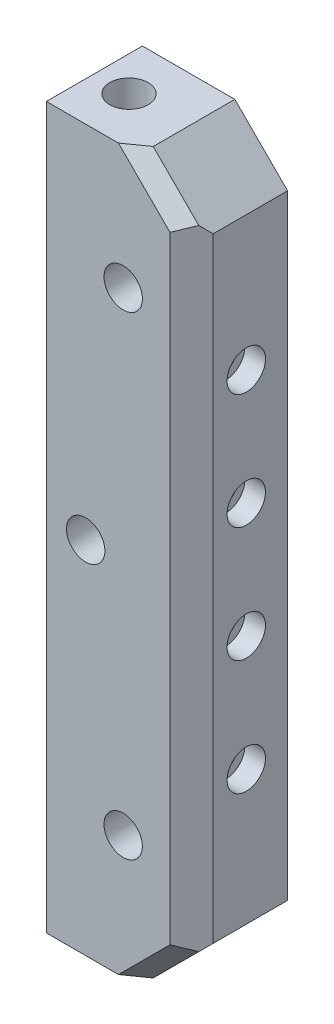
ISO-10303-21;
HEADER;
FILE_DESCRIPTION(('STEP AP214'),'2;1');
FILE_NAME('part.step','',(''),(''),'','','');
FILE_SCHEMA(('AUTOMOTIVE_DESIGN { 1 0 10303 214 1 1 1 1 }'));
ENDSEC;
DATA;
#1=APPLICATION_CONTEXT('core data for automotive mechanical design processes');
#2=APPLICATION_PROTOCOL_DEFINITION('international standard','automotive_design',2000,#1);
#3=PRODUCT_CONTEXT('',#1,'mechanical');
#4=PRODUCT('Part','Part','',(#3));
#5=PRODUCT_RELATED_PRODUCT_CATEGORY('part','',(#4));
#6=PRODUCT_DEFINITION_FORMATION('','',#4);
#7=PRODUCT_DEFINITION_CONTEXT('part definition',#1,'design');
#8=PRODUCT_DEFINITION('design','',#6,#7);
#9=PRODUCT_DEFINITION_SHAPE('','',#8);
#10=(LENGTH_UNIT() NAMED_UNIT(*) SI_UNIT(.MILLI.,.METRE.));
#11=(NAMED_UNIT(*) PLANE_ANGLE_UNIT() SI_UNIT($,.RADIAN.));
#12=(NAMED_UNIT(*) SI_UNIT($,.STERADIAN.) SOLID_ANGLE_UNIT());
#13=UNCERTAINTY_MEASURE_WITH_UNIT(LENGTH_MEASURE(1.E-05),#10,'distance_accuracy_value','');
#14=(GEOMETRIC_REPRESENTATION_CONTEXT(3) GLOBAL_UNCERTAINTY_ASSIGNED_CONTEXT((#13)) GLOBAL_UNIT_ASSIGNED_CONTEXT((#10,
#11,#12)) REPRESENTATION_CONTEXT('',''));
#15=CARTESIAN_POINT('',(0.,0.,0.));
#16=DIRECTION('',(0.,0.,1.));
#17=DIRECTION('',(1.,0.,0.));
#18=AXIS2_PLACEMENT_3D('',#15,#16,#17);
#19=CARTESIAN_POINT('',(0.,150.,20.));
#20=DIRECTION('',(0.,-1.,0.));
#21=DIRECTION('',(0.,0.,-1.));
#22=AXIS2_PLACEMENT_3D('',#19,#20,#21);
#23=PLANE('',#22);
#24=DIRECTION('',(-1.,0.,0.));
#25=VECTOR('',#24,1.);
#26=CARTESIAN_POINT('',(0.,150.,20.));
#27=LINE('',#26,#25);
#28=CARTESIAN_POINT('',(15.0073593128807,150.,20.));
#29=VERTEX_POINT('',#28);
#30=CARTESIAN_POINT('',(0.,150.,20.));
#31=VERTEX_POINT('',#30);
#32=EDGE_CURVE('E166',#29,#31,#27,.T.);
#33=ORIENTED_EDGE('',*,*,#32,.F.);
#34=DIRECTION('',(-0.816496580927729,0.,0.577350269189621));
#35=VECTOR('',#34,1.);
#36=CARTESIAN_POINT('',(10.0049062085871,150.,23.5372685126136));
#37=LINE('',#36,#35);
#38=CARTESIAN_POINT('',(19.25,150.,17.));
#39=VERTEX_POINT('',#38);
#40=EDGE_CURVE('E211',#29,#39,#37,.F.);
#41=ORIENTED_EDGE('',*,*,#40,.T.);
#42=DIRECTION('',(0.,0.,-1.));
#43=VECTOR('',#42,1.);
#44=CARTESIAN_POINT('',(19.25,150.,20.));
#45=LINE('',#44,#43);
#46=CARTESIAN_POINT('',(19.25,150.,0.));
#47=VERTEX_POINT('',#46);
#48=EDGE_CURVE('E183',#39,#47,#45,.T.);
#49=ORIENTED_EDGE('',*,*,#48,.T.);
#50=DIRECTION('',(-1.,0.,0.));
#51=VECTOR('',#50,1.);
#52=CARTESIAN_POINT('',(0.,150.,0.));
#53=LINE('',#52,#51);
#54=CARTESIAN_POINT('',(0.,150.,0.));
#55=VERTEX_POINT('',#54);
#56=EDGE_CURVE('E163',#47,#55,#53,.T.);
#57=ORIENTED_EDGE('',*,*,#56,.T.);
#58=DIRECTION('',(0.,0.,-1.));
#59=VECTOR('',#58,1.);
#60=CARTESIAN_POINT('',(0.,150.,20.));
#61=LINE('',#60,#59);
#62=EDGE_CURVE('E168',#31,#55,#61,.T.);
#63=ORIENTED_EDGE('',*,*,#62,.F.);
#64=EDGE_LOOP('',(#33,#41,#49,#57,#63));
#65=FACE_BOUND('',#64,.T.);
#66=CARTESIAN_POINT('',(7.2,150.,10.));
#67=DIRECTION('',(0.,-1.,0.));
#68=DIRECTION('',(0.,0.,-1.));
#69=AXIS2_PLACEMENT_3D('',#66,#67,#68);
#70=CIRCLE('',#69,4.);
#71=CARTESIAN_POINT('',(7.2,150.,6.));
#72=VERTEX_POINT('',#71);
#73=EDGE_CURVE('E668',#72,#72,#70,.T.);
#74=ORIENTED_EDGE('',*,*,#73,.T.);
#75=EDGE_LOOP('',(#74));
#76=FACE_BOUND('',#75,.T.);
#77=ADVANCED_FACE('F36',(#65,#76),#23,.F.);
#78=CARTESIAN_POINT('',(0.,0.,20.));
#79=DIRECTION('',(1.,0.,0.));
#80=DIRECTION('',(0.,0.,-1.));
#81=AXIS2_PLACEMENT_3D('',#78,#79,#80);
#82=PLANE('',#81);
#83=CARTESIAN_POINT('',(0.,111.,8.61205743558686));
#84=DIRECTION('',(1.,0.,0.));
#85=DIRECTION('',(0.,0.,-1.));
#86=AXIS2_PLACEMENT_3D('',#83,#84,#85);
#87=CIRCLE('',#86,2.2);
#88=CARTESIAN_POINT('',(0.,111.,6.41205743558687));
#89=VERTEX_POINT('',#88);
#90=EDGE_CURVE('E697',#89,#89,#87,.T.);
#91=ORIENTED_EDGE('',*,*,#90,.T.);
#92=EDGE_LOOP('',(#91));
#93=FACE_BOUND('',#92,.T.);
#94=CARTESIAN_POINT('',(0.,87.,8.61205743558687));
#95=DIRECTION('',(1.,0.,0.));
#96=DIRECTION('',(0.,0.,-1.));
#97=AXIS2_PLACEMENT_3D('',#94,#95,#96);
#98=CIRCLE('',#97,2.2);
#99=CARTESIAN_POINT('',(0.,87.,6.41205743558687));
#100=VERTEX_POINT('',#99);
#101=EDGE_CURVE('E703',#100,#100,#98,.T.);
#102=ORIENTED_EDGE('',*,*,#101,.T.);
#103=EDGE_LOOP('',(#102));
#104=FACE_BOUND('',#103,.T.);
#105=CARTESIAN_POINT('',(0.,63.,8.61205743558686));
#106=DIRECTION('',(1.,0.,0.));
#107=DIRECTION('',(0.,0.,-1.));
#108=AXIS2_PLACEMENT_3D('',#105,#106,#107);
#109=CIRCLE('',#108,2.2);
#110=CARTESIAN_POINT('',(0.,63.,6.41205743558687));
#111=VERTEX_POINT('',#110);
#112=EDGE_CURVE('E709',#111,#111,#109,.T.);
#113=ORIENTED_EDGE('',*,*,#112,.T.);
#114=EDGE_LOOP('',(#113));
#115=FACE_BOUND('',#114,.T.);
#116=CARTESIAN_POINT('',(0.,39.,8.61205743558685));
#117=DIRECTION('',(1.,0.,0.));
#118=DIRECTION('',(0.,0.,-1.));
#119=AXIS2_PLACEMENT_3D('',#116,#117,#118);
#120=CIRCLE('',#119,2.2);
#121=CARTESIAN_POINT('',(0.,39.,6.41205743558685));
#122=VERTEX_POINT('',#121);
#123=EDGE_CURVE('E715',#122,#122,#120,.T.);
#124=ORIENTED_EDGE('',*,*,#123,.T.);
#125=EDGE_LOOP('',(#124));
#126=FACE_BOUND('',#125,.T.);
#127=DIRECTION('',(0.,0.,-1.));
#128=VECTOR('',#127,1.);
#129=CARTESIAN_POINT('',(0.,0.,20.));
#130=LINE('',#129,#128);
#131=CARTESIAN_POINT('',(0.,0.,12.57));
#132=VERTEX_POINT('',#131);
#133=CARTESIAN_POINT('',(0.,0.,0.));
#134=VERTEX_POINT('',#133);
#135=EDGE_CURVE('E181',#132,#134,#130,.T.);
#136=ORIENTED_EDGE('',*,*,#135,.F.);
#137=DIRECTION('',(0.,-1.,0.));
#138=VECTOR('',#137,1.);
#139=CARTESIAN_POINT('',(0.,125.,12.57));
#140=LINE('',#139,#138);
#141=CARTESIAN_POINT('',(0.,125.,12.57));
#142=VERTEX_POINT('',#141);
#143=EDGE_CURVE('E260',#142,#132,#140,.T.);
#144=ORIENTED_EDGE('',*,*,#143,.F.);
#145=DIRECTION('',(0.,0.,-1.));
#146=VECTOR('',#145,1.);
#147=CARTESIAN_POINT('',(0.,125.,12.57));
#148=LINE('',#147,#146);
#149=CARTESIAN_POINT('',(0.,125.,17.8));
#150=VERTEX_POINT('',#149);
#151=EDGE_CURVE('E262',#150,#142,#148,.T.);
#152=ORIENTED_EDGE('',*,*,#151,.F.);
#153=DIRECTION('',(0.,1.,0.));
#154=VECTOR('',#153,1.);
#155=CARTESIAN_POINT('',(0.,125.,17.8));
#156=LINE('',#155,#154);
#157=CARTESIAN_POINT('',(0.,0.,17.8));
#158=VERTEX_POINT('',#157);
#159=EDGE_CURVE('E264',#158,#150,#156,.T.);
#160=ORIENTED_EDGE('',*,*,#159,.F.);
#161=CARTESIAN_POINT('',(0.,0.,20.));
#162=VERTEX_POINT('',#161);
#163=EDGE_CURVE('E151',#162,#158,#130,.T.);
#164=ORIENTED_EDGE('',*,*,#163,.F.);
#165=DIRECTION('',(0.,-1.,0.));
#166=VECTOR('',#165,1.);
#167=CARTESIAN_POINT('',(0.,0.,20.));
#168=LINE('',#167,#166);
#169=EDGE_CURVE('E159',#31,#162,#168,.T.);
#170=ORIENTED_EDGE('',*,*,#169,.F.);
#171=ORIENTED_EDGE('',*,*,#62,.T.);
#172=DIRECTION('',(0.,-1.,0.));
#173=VECTOR('',#172,1.);
#174=CARTESIAN_POINT('',(0.,0.,0.));
#175=LINE('',#174,#173);
#176=EDGE_CURVE('E169',#55,#134,#175,.T.);
#177=ORIENTED_EDGE('',*,*,#176,.T.);
#178=EDGE_LOOP('',(#136,#144,#152,#160,#164,#170,#171,#177));
#179=FACE_BOUND('',#178,.T.);
#180=ADVANCED_FACE('F249',(#93,#104,#115,#126,#179),#82,.F.);
#181=CARTESIAN_POINT('',(0.,0.,20.));
#182=DIRECTION('',(0.,1.,0.));
#183=DIRECTION('',(0.,0.,1.));
#184=AXIS2_PLACEMENT_3D('',#181,#182,#183);
#185=PLANE('',#184);
#186=CARTESIAN_POINT('',(7.2,0.,10.));
#187=DIRECTION('',(0.,-1.,0.));
#188=DIRECTION('',(0.,0.,-1.));
#189=AXIS2_PLACEMENT_3D('',#186,#187,#188);
#190=CIRCLE('',#189,4.);
#191=CARTESIAN_POINT('',(7.2,0.,6.));
#192=VERTEX_POINT('',#191);
#193=EDGE_CURVE('E667',#192,#192,#190,.T.);
#194=ORIENTED_EDGE('',*,*,#193,.F.);
#195=EDGE_LOOP('',(#194));
#196=FACE_BOUND('',#195,.T.);
#197=DIRECTION('',(0.,0.,1.));
#198=VECTOR('',#197,1.);
#199=CARTESIAN_POINT('',(1.4,0.,12.57));
#200=LINE('',#199,#198);
#201=CARTESIAN_POINT('',(1.4,0.,12.57));
#202=VERTEX_POINT('',#201);
#203=CARTESIAN_POINT('',(1.4,0.,17.8));
#204=VERTEX_POINT('',#203);
#205=EDGE_CURVE('E141',#202,#204,#200,.T.);
#206=ORIENTED_EDGE('',*,*,#205,.F.);
#207=DIRECTION('',(-1.,0.,0.));
#208=VECTOR('',#207,1.);
#209=CARTESIAN_POINT('',(1.4,0.,12.57));
#210=LINE('',#209,#208);
#211=EDGE_CURVE('E152',#202,#132,#210,.T.);
#212=ORIENTED_EDGE('',*,*,#211,.T.);
#213=ORIENTED_EDGE('',*,*,#135,.T.);
#214=DIRECTION('',(1.,0.,0.));
#215=VECTOR('',#214,1.);
#216=CARTESIAN_POINT('',(0.,0.,0.));
#217=LINE('',#216,#215);
#218=CARTESIAN_POINT('',(19.2499999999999,0.,0.));
#219=VERTEX_POINT('',#218);
#220=EDGE_CURVE('E172',#134,#219,#217,.T.);
#221=ORIENTED_EDGE('',*,*,#220,.T.);
#222=DIRECTION('',(0.,0.,1.));
#223=VECTOR('',#222,1.);
#224=CARTESIAN_POINT('',(19.2499999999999,0.,20.));
#225=LINE('',#224,#223);
#226=CARTESIAN_POINT('',(19.2499999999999,0.,17.));
#227=VERTEX_POINT('',#226);
#228=EDGE_CURVE('E194',#219,#227,#225,.T.);
#229=ORIENTED_EDGE('',*,*,#228,.T.);
#230=DIRECTION('',(0.816496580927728,0.,-0.577350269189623));
#231=VECTOR('',#230,1.);
#232=CARTESIAN_POINT('',(60.0049062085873,0.,-11.8180705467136));
#233=LINE('',#232,#231);
#234=CARTESIAN_POINT('',(15.0073593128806,0.,20.));
#235=VERTEX_POINT('',#234);
#236=EDGE_CURVE('E11',#227,#235,#233,.F.);
#237=ORIENTED_EDGE('',*,*,#236,.T.);
#238=DIRECTION('',(1.,0.,0.));
#239=VECTOR('',#238,1.);
#240=CARTESIAN_POINT('',(0.,0.,20.));
#241=LINE('',#240,#239);
#242=EDGE_CURVE('E162',#162,#235,#241,.T.);
#243=ORIENTED_EDGE('',*,*,#242,.F.);
#244=ORIENTED_EDGE('',*,*,#163,.T.);
#245=DIRECTION('',(-1.,0.,0.));
#246=VECTOR('',#245,1.);
#247=CARTESIAN_POINT('',(1.4,0.,17.8));
#248=LINE('',#247,#246);
#249=EDGE_CURVE('E136',#204,#158,#248,.T.);
#250=ORIENTED_EDGE('',*,*,#249,.F.);
#251=EDGE_LOOP('',(#206,#212,#213,#221,#229,#237,#243,#244,#250));
#252=FACE_BOUND('',#251,.T.);
#253=ADVANCED_FACE('F149',(#196,#252),#185,.F.);
#254=CARTESIAN_POINT('',(30.25,0.,20.));
#255=DIRECTION('',(-1.,0.,0.));
#256=DIRECTION('',(0.,0.,1.));
#257=AXIS2_PLACEMENT_3D('',#254,#255,#256);
#258=PLANE('',#257);
#259=CARTESIAN_POINT('',(30.25,63.,8.61205743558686));
#260=DIRECTION('',(1.,0.,0.));
#261=DIRECTION('',(0.,0.,1.));
#262=AXIS2_PLACEMENT_3D('',#259,#260,#261);
#263=CIRCLE('',#262,4.);
#264=CARTESIAN_POINT('',(30.25,63.,4.61205743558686));
#265=VERTEX_POINT('',#264);
#266=EDGE_CURVE('E718',#265,#265,#263,.T.);
#267=ORIENTED_EDGE('',*,*,#266,.F.);
#268=EDGE_LOOP('',(#267));
#269=FACE_BOUND('',#268,.T.);
#270=CARTESIAN_POINT('',(30.25,39.,8.61205743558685));
#271=DIRECTION('',(1.,0.,0.));
#272=DIRECTION('',(0.,0.,1.));
#273=AXIS2_PLACEMENT_3D('',#270,#271,#272);
#274=CIRCLE('',#273,4.);
#275=CARTESIAN_POINT('',(30.25,39.,4.61205743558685));
#276=VERTEX_POINT('',#275);
#277=EDGE_CURVE('E724',#276,#276,#274,.T.);
#278=ORIENTED_EDGE('',*,*,#277,.F.);
#279=EDGE_LOOP('',(#278));
#280=FACE_BOUND('',#279,.T.);
#281=CARTESIAN_POINT('',(30.25,111.,8.61205743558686));
#282=DIRECTION('',(1.,0.,0.));
#283=DIRECTION('',(0.,0.,-1.));
#284=AXIS2_PLACEMENT_3D('',#281,#282,#283);
#285=CIRCLE('',#284,4.);
#286=CARTESIAN_POINT('',(30.25,111.,4.61205743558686));
#287=VERTEX_POINT('',#286);
#288=EDGE_CURVE('E730',#287,#287,#285,.T.);
#289=ORIENTED_EDGE('',*,*,#288,.F.);
#290=EDGE_LOOP('',(#289));
#291=FACE_BOUND('',#290,.T.);
#292=CARTESIAN_POINT('',(30.25,87.,8.61205743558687));
#293=DIRECTION('',(1.,0.,0.));
#294=DIRECTION('',(0.,0.,-1.));
#295=AXIS2_PLACEMENT_3D('',#292,#293,#294);
#296=CIRCLE('',#295,4.);
#297=CARTESIAN_POINT('',(30.25,87.,4.61205743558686));
#298=VERTEX_POINT('',#297);
#299=EDGE_CURVE('E269',#298,#298,#296,.T.);
#300=ORIENTED_EDGE('',*,*,#299,.F.);
#301=EDGE_LOOP('',(#300));
#302=FACE_BOUND('',#301,.T.);
#303=DIRECTION('',(0.,0.,1.));
#304=VECTOR('',#303,1.);
#305=CARTESIAN_POINT('',(30.25,139.,20.));
#306=LINE('',#305,#304);
#307=CARTESIAN_POINT('',(30.25,139.,0.));
#308=VERTEX_POINT('',#307);
#309=CARTESIAN_POINT('',(30.25,139.,15.5));
#310=VERTEX_POINT('',#309);
#311=EDGE_CURVE('E191',#308,#310,#306,.T.);
#312=ORIENTED_EDGE('',*,*,#311,.T.);
#313=DIRECTION('',(0.,-1.,0.));
#314=VECTOR('',#313,1.);
#315=CARTESIAN_POINT('',(30.25,0.,15.5));
#316=LINE('',#315,#314);
#317=CARTESIAN_POINT('',(30.25,11.,15.5));
#318=VERTEX_POINT('',#317);
#319=EDGE_CURVE('E201',#310,#318,#316,.T.);
#320=ORIENTED_EDGE('',*,*,#319,.T.);
#321=DIRECTION('',(0.,0.,-1.));
#322=VECTOR('',#321,1.);
#323=CARTESIAN_POINT('',(30.25,11.,20.));
#324=LINE('',#323,#322);
#325=CARTESIAN_POINT('',(30.25,11.,0.));
#326=VERTEX_POINT('',#325);
#327=EDGE_CURVE('E189',#318,#326,#324,.T.);
#328=ORIENTED_EDGE('',*,*,#327,.T.);
#329=DIRECTION('',(0.,1.,0.));
#330=VECTOR('',#329,1.);
#331=CARTESIAN_POINT('',(30.25,0.,0.));
#332=LINE('',#331,#330);
#333=EDGE_CURVE('E175',#326,#308,#332,.T.);
#334=ORIENTED_EDGE('',*,*,#333,.T.);
#335=EDGE_LOOP('',(#312,#320,#328,#334));
#336=FACE_BOUND('',#335,.T.);
#337=ADVANCED_FACE('F257',(#269,#280,#291,#302,#336),#258,.F.);
#338=CARTESIAN_POINT('',(0.,150.,20.));
#339=DIRECTION('',(0.,0.,-1.));
#340=DIRECTION('',(-1.,0.,0.));
#341=AXIS2_PLACEMENT_3D('',#338,#339,#340);
#342=PLANE('',#341);
#343=CARTESIAN_POINT('',(16.,25.6144731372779,20.));
#344=DIRECTION('',(0.,0.,1.));
#345=DIRECTION('',(-1.,0.,0.));
#346=AXIS2_PLACEMENT_3D('',#343,#344,#345);
#347=CIRCLE('',#346,4.);
#348=CARTESIAN_POINT('',(12.,25.6144731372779,20.));
#349=VERTEX_POINT('',#348);
#350=EDGE_CURVE('E677',#349,#349,#347,.T.);
#351=ORIENTED_EDGE('',*,*,#350,.F.);
#352=EDGE_LOOP('',(#351));
#353=FACE_BOUND('',#352,.T.);
#354=CARTESIAN_POINT('',(16.,124.385526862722,20.));
#355=DIRECTION('',(0.,0.,1.));
#356=DIRECTION('',(1.,0.,0.));
#357=AXIS2_PLACEMENT_3D('',#354,#355,#356);
#358=CIRCLE('',#357,4.);
#359=CARTESIAN_POINT('',(20.,124.385526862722,20.));
#360=VERTEX_POINT('',#359);
#361=EDGE_CURVE('E682',#360,#360,#358,.T.);
#362=ORIENTED_EDGE('',*,*,#361,.F.);
#363=EDGE_LOOP('',(#362));
#364=FACE_BOUND('',#363,.T.);
#365=CARTESIAN_POINT('',(8.18528717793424,75.,20.));
#366=DIRECTION('',(0.,0.,1.));
#367=DIRECTION('',(1.,0.,0.));
#368=AXIS2_PLACEMENT_3D('',#365,#366,#367);
#369=CIRCLE('',#368,4.);
#370=CARTESIAN_POINT('',(12.1852871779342,75.,20.));
#371=VERTEX_POINT('',#370);
#372=EDGE_CURVE('E688',#371,#371,#369,.T.);
#373=ORIENTED_EDGE('',*,*,#372,.F.);
#374=EDGE_LOOP('',(#373));
#375=FACE_BOUND('',#374,.T.);
#376=DIRECTION('',(0.,1.,0.));
#377=VECTOR('',#376,1.);
#378=CARTESIAN_POINT('',(25.75,150.,20.));
#379=LINE('',#378,#377);
#380=CARTESIAN_POINT('',(25.75,10.7426406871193,20.));
#381=VERTEX_POINT('',#380);
#382=CARTESIAN_POINT('',(25.75,139.257359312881,20.));
#383=VERTEX_POINT('',#382);
#384=EDGE_CURVE('E196',#381,#383,#379,.T.);
#385=ORIENTED_EDGE('',*,*,#384,.T.);
#386=DIRECTION('',(-0.707106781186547,0.707106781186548,0.));
#387=VECTOR('',#386,1.);
#388=CARTESIAN_POINT('',(17.1286796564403,147.87867965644,20.));
#389=LINE('',#388,#387);
#390=EDGE_CURVE('E208',#383,#29,#389,.T.);
#391=ORIENTED_EDGE('',*,*,#390,.T.);
#392=ORIENTED_EDGE('',*,*,#32,.T.);
#393=ORIENTED_EDGE('',*,*,#169,.T.);
#394=ORIENTED_EDGE('',*,*,#242,.T.);
#395=DIRECTION('',(0.707106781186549,0.707106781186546,0.));
#396=VECTOR('',#395,1.);
#397=CARTESIAN_POINT('',(23.6286796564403,8.62132034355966,20.));
#398=LINE('',#397,#396);
#399=EDGE_CURVE('E205',#235,#381,#398,.T.);
#400=ORIENTED_EDGE('',*,*,#399,.T.);
#401=EDGE_LOOP('',(#385,#391,#392,#393,#394,#400));
#402=FACE_BOUND('',#401,.T.);
#403=ADVANCED_FACE('F228',(#353,#364,#375,#402),#342,.F.);
#404=CARTESIAN_POINT('',(0.,150.,0.));
#405=DIRECTION('',(0.,0.,-1.));
#406=DIRECTION('',(-1.,0.,0.));
#407=AXIS2_PLACEMENT_3D('',#404,#405,#406);
#408=PLANE('',#407);
#409=ORIENTED_EDGE('',*,*,#56,.F.);
#410=DIRECTION('',(-0.707106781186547,0.707106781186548,0.));
#411=VECTOR('',#410,1.);
#412=CARTESIAN_POINT('',(9.62500000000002,159.625,0.));
#413=LINE('',#412,#411);
#414=EDGE_CURVE('E187',#47,#308,#413,.F.);
#415=ORIENTED_EDGE('',*,*,#414,.T.);
#416=ORIENTED_EDGE('',*,*,#333,.F.);
#417=DIRECTION('',(0.707106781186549,0.707106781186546,0.));
#418=VECTOR('',#417,1.);
#419=CARTESIAN_POINT('',(84.6249999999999,65.3749999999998,0.));
#420=LINE('',#419,#418);
#421=EDGE_CURVE('E185',#326,#219,#420,.F.);
#422=ORIENTED_EDGE('',*,*,#421,.T.);
#423=ORIENTED_EDGE('',*,*,#220,.F.);
#424=ORIENTED_EDGE('',*,*,#176,.F.);
#425=EDGE_LOOP('',(#409,#415,#416,#422,#423,#424));
#426=FACE_BOUND('',#425,.T.);
#427=ADVANCED_FACE('F244',(#426),#408,.T.);
#428=CARTESIAN_POINT('',(19.25,150.,20.));
#429=DIRECTION('',(-0.707106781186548,-0.707106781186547,0.));
#430=DIRECTION('',(0.707106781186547,-0.707106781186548,0.));
#431=AXIS2_PLACEMENT_3D('',#428,#429,#430);
#432=PLANE('',#431);
#433=ORIENTED_EDGE('',*,*,#48,.F.);
#434=DIRECTION('',(-0.707106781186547,0.707106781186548,0.));
#435=VECTOR('',#434,1.);
#436=CARTESIAN_POINT('',(25.75,143.5,17.));
#437=LINE('',#436,#435);
#438=CARTESIAN_POINT('',(28.75,140.5,17.));
#439=VERTEX_POINT('',#438);
#440=EDGE_CURVE('E213',#39,#439,#437,.F.);
#441=ORIENTED_EDGE('',*,*,#440,.T.);
#442=DIRECTION('',(0.577350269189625,-0.577350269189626,-0.577350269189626));
#443=VECTOR('',#442,1.);
#444=CARTESIAN_POINT('',(21.4166666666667,147.833333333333,24.3333333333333));
#445=LINE('',#444,#443);
#446=EDGE_CURVE('E199',#439,#310,#445,.T.);
#447=ORIENTED_EDGE('',*,*,#446,.T.);
#448=ORIENTED_EDGE('',*,*,#311,.F.);
#449=ORIENTED_EDGE('',*,*,#414,.F.);
#450=EDGE_LOOP('',(#433,#441,#447,#448,#449));
#451=FACE_BOUND('',#450,.T.);
#452=ADVANCED_FACE('F238',(#451),#432,.F.);
#453=CARTESIAN_POINT('',(30.25,11.,20.));
#454=DIRECTION('',(-0.707106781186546,0.707106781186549,0.));
#455=DIRECTION('',(-0.707106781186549,-0.707106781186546,0.));
#456=AXIS2_PLACEMENT_3D('',#453,#454,#455);
#457=PLANE('',#456);
#458=DIRECTION('',(-0.577350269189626,-0.577350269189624,0.577350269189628));
#459=VECTOR('',#458,1.);
#460=CARTESIAN_POINT('',(28.75,9.5,17.));
#461=LINE('',#460,#459);
#462=CARTESIAN_POINT('',(28.75,9.49999999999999,17.));
#463=VERTEX_POINT('',#462);
#464=EDGE_CURVE('E203',#318,#463,#461,.T.);
#465=ORIENTED_EDGE('',*,*,#464,.T.);
#466=DIRECTION('',(0.707106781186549,0.707106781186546,0.));
#467=VECTOR('',#466,1.);
#468=CARTESIAN_POINT('',(19.2499999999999,0.,17.));
#469=LINE('',#468,#467);
#470=EDGE_CURVE('E44',#463,#227,#469,.F.);
#471=ORIENTED_EDGE('',*,*,#470,.T.);
#472=ORIENTED_EDGE('',*,*,#228,.F.);
#473=ORIENTED_EDGE('',*,*,#421,.F.);
#474=ORIENTED_EDGE('',*,*,#327,.F.);
#475=EDGE_LOOP('',(#465,#471,#472,#473,#474));
#476=FACE_BOUND('',#475,.T.);
#477=ADVANCED_FACE('F254',(#476),#457,.F.);
#478=CARTESIAN_POINT('',(25.75,150.,20.));
#479=DIRECTION('',(-0.707106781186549,0.,-0.707106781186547));
#480=DIRECTION('',(-0.707106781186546,0.,0.707106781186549));
#481=AXIS2_PLACEMENT_3D('',#478,#479,#480);
#482=PLANE('',#481);
#483=ORIENTED_EDGE('',*,*,#446,.F.);
#484=DIRECTION('',(-0.678598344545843,-0.281084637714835,0.678598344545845));
#485=VECTOR('',#484,1.);
#486=CARTESIAN_POINT('',(27.7990896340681,140.10612002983,17.9509103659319));
#487=LINE('',#486,#485);
#488=EDGE_CURVE('E217',#439,#383,#487,.T.);
#489=ORIENTED_EDGE('',*,*,#488,.T.);
#490=ORIENTED_EDGE('',*,*,#384,.F.);
#491=DIRECTION('',(0.678598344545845,-0.281084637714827,-0.678598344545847));
#492=VECTOR('',#491,1.);
#493=CARTESIAN_POINT('',(-0.812445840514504,21.7451660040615,46.5624458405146));
#494=LINE('',#493,#492);
#495=EDGE_CURVE('E215',#381,#463,#494,.T.);
#496=ORIENTED_EDGE('',*,*,#495,.T.);
#497=ORIENTED_EDGE('',*,*,#464,.F.);
#498=ORIENTED_EDGE('',*,*,#319,.F.);
#499=EDGE_LOOP('',(#483,#489,#490,#496,#497,#498));
#500=FACE_BOUND('',#499,.T.);
#501=ADVANCED_FACE('F222',(#500),#482,.F.);
#502=CARTESIAN_POINT('',(7.50367965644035,157.50367965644,20.));
#503=DIRECTION('',(-0.499999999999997,-0.499999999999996,-0.707106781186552));
#504=DIRECTION('',(-0.816496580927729,0.,0.577350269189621));
#505=AXIS2_PLACEMENT_3D('',#502,#503,#504);
#506=PLANE('',#505);
#507=ORIENTED_EDGE('',*,*,#488,.F.);
#508=ORIENTED_EDGE('',*,*,#440,.F.);
#509=ORIENTED_EDGE('',*,*,#40,.F.);
#510=ORIENTED_EDGE('',*,*,#390,.F.);
#511=EDGE_LOOP('',(#507,#508,#509,#510));
#512=FACE_BOUND('',#511,.T.);
#513=ADVANCED_FACE('F231',(#512),#506,.F.);
#514=CARTESIAN_POINT('',(82.5036796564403,67.4963203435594,20.));
#515=DIRECTION('',(-0.499999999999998,0.5,-0.707106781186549));
#516=DIRECTION('',(0.,0.816496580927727,0.577350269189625));
#517=AXIS2_PLACEMENT_3D('',#514,#515,#516);
#518=PLANE('',#517);
#519=ORIENTED_EDGE('',*,*,#236,.F.);
#520=ORIENTED_EDGE('',*,*,#470,.F.);
#521=ORIENTED_EDGE('',*,*,#495,.F.);
#522=ORIENTED_EDGE('',*,*,#399,.F.);
#523=EDGE_LOOP('',(#519,#520,#521,#522));
#524=FACE_BOUND('',#523,.T.);
#525=ADVANCED_FACE('F38',(#524),#518,.F.);
#526=CARTESIAN_POINT('',(1.4,125.,12.57));
#527=DIRECTION('',(0.,0.,-1.));
#528=DIRECTION('',(0.,1.,0.));
#529=AXIS2_PLACEMENT_3D('',#526,#527,#528);
#530=PLANE('',#529);
#531=ORIENTED_EDGE('',*,*,#143,.T.);
#532=ORIENTED_EDGE('',*,*,#211,.F.);
#533=DIRECTION('',(0.,-1.,0.));
#534=VECTOR('',#533,1.);
#535=CARTESIAN_POINT('',(1.4,125.,12.57));
#536=LINE('',#535,#534);
#537=CARTESIAN_POINT('',(1.4,125.,12.57));
#538=VERTEX_POINT('',#537);
#539=EDGE_CURVE('E51',#538,#202,#536,.T.);
#540=ORIENTED_EDGE('',*,*,#539,.F.);
#541=DIRECTION('',(-1.,0.,0.));
#542=VECTOR('',#541,1.);
#543=CARTESIAN_POINT('',(1.4,125.,12.57));
#544=LINE('',#543,#542);
#545=EDGE_CURVE('E154',#538,#142,#544,.T.);
#546=ORIENTED_EDGE('',*,*,#545,.T.);
#547=EDGE_LOOP('',(#531,#532,#540,#546));
#548=FACE_BOUND('',#547,.T.);
#549=ADVANCED_FACE('F273',(#548),#530,.F.);
#550=CARTESIAN_POINT('',(1.4,125.,12.57));
#551=DIRECTION('',(0.,1.,0.));
#552=DIRECTION('',(0.,0.,1.));
#553=AXIS2_PLACEMENT_3D('',#550,#551,#552);
#554=PLANE('',#553);
#555=ORIENTED_EDGE('',*,*,#151,.T.);
#556=ORIENTED_EDGE('',*,*,#545,.F.);
#557=DIRECTION('',(0.,0.,-1.));
#558=VECTOR('',#557,1.);
#559=CARTESIAN_POINT('',(1.4,125.,12.57));
#560=LINE('',#559,#558);
#561=CARTESIAN_POINT('',(1.4,125.,17.8));
#562=VERTEX_POINT('',#561);
#563=EDGE_CURVE('E140',#562,#538,#560,.T.);
#564=ORIENTED_EDGE('',*,*,#563,.F.);
#565=DIRECTION('',(-1.,0.,0.));
#566=VECTOR('',#565,1.);
#567=CARTESIAN_POINT('',(1.4,125.,17.8));
#568=LINE('',#567,#566);
#569=EDGE_CURVE('E138',#562,#150,#568,.T.);
#570=ORIENTED_EDGE('',*,*,#569,.T.);
#571=EDGE_LOOP('',(#555,#556,#564,#570));
#572=FACE_BOUND('',#571,.T.);
#573=ADVANCED_FACE('F275',(#572),#554,.F.);
#574=CARTESIAN_POINT('',(1.4,125.,17.8));
#575=DIRECTION('',(0.,0.,1.));
#576=DIRECTION('',(0.,-1.,0.));
#577=AXIS2_PLACEMENT_3D('',#574,#575,#576);
#578=PLANE('',#577);
#579=ORIENTED_EDGE('',*,*,#159,.T.);
#580=ORIENTED_EDGE('',*,*,#569,.F.);
#581=DIRECTION('',(0.,1.,0.));
#582=VECTOR('',#581,1.);
#583=CARTESIAN_POINT('',(1.4,125.,17.8));
#584=LINE('',#583,#582);
#585=EDGE_CURVE('E132',#204,#562,#584,.T.);
#586=ORIENTED_EDGE('',*,*,#585,.F.);
#587=ORIENTED_EDGE('',*,*,#249,.T.);
#588=EDGE_LOOP('',(#579,#580,#586,#587));
#589=FACE_BOUND('',#588,.T.);
#590=ADVANCED_FACE('F134',(#589),#578,.F.);
#591=CARTESIAN_POINT('',(1.4,125.,12.57));
#592=DIRECTION('',(-1.,0.,0.));
#593=DIRECTION('',(0.,0.,1.));
#594=AXIS2_PLACEMENT_3D('',#591,#592,#593);
#595=PLANE('',#594);
#596=ORIENTED_EDGE('',*,*,#539,.T.);
#597=ORIENTED_EDGE('',*,*,#205,.T.);
#598=ORIENTED_EDGE('',*,*,#585,.T.);
#599=ORIENTED_EDGE('',*,*,#563,.T.);
#600=EDGE_LOOP('',(#596,#597,#598,#599));
#601=FACE_BOUND('',#600,.T.);
#602=ADVANCED_FACE('F144',(#601),#595,.T.);
#603=CARTESIAN_POINT('',(25.95,87.,8.61205743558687));
#604=DIRECTION('',(1.,0.,0.));
#605=DIRECTION('',(0.,0.,-1.));
#606=AXIS2_PLACEMENT_3D('',#603,#604,#605);
#607=CYLINDRICAL_SURFACE('',#606,4.);
#608=CARTESIAN_POINT('',(25.95,87.,8.61205743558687));
#609=DIRECTION('',(1.,0.,0.));
#610=DIRECTION('',(0.,0.,-1.));
#611=AXIS2_PLACEMENT_3D('',#608,#609,#610);
#612=CIRCLE('',#611,4.);
#613=CARTESIAN_POINT('',(25.95,87.,4.61205743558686));
#614=VERTEX_POINT('',#613);
#615=EDGE_CURVE('E265',#614,#614,#612,.T.);
#616=CARTESIAN_POINT('',(25.95,87.,4.61205743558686));
#617=CARTESIAN_POINT('',(25.9947916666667,87.,4.61205743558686));
#618=CARTESIAN_POINT('',(26.0395833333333,87.,4.61205743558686));
#619=CARTESIAN_POINT('',(26.1291666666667,87.,4.61205743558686));
#620=CARTESIAN_POINT('',(26.1739583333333,87.,4.61205743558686));
#621=CARTESIAN_POINT('',(26.2635416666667,87.,4.61205743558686));
#622=CARTESIAN_POINT('',(26.3083333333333,87.,4.61205743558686));
#623=CARTESIAN_POINT('',(26.3979166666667,87.,4.61205743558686));
#624=CARTESIAN_POINT('',(26.4427083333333,87.,4.61205743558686));
#625=CARTESIAN_POINT('',(26.5322916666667,87.,4.61205743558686));
#626=CARTESIAN_POINT('',(26.5770833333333,87.,4.61205743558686));
#627=CARTESIAN_POINT('',(26.6666666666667,87.,4.61205743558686));
#628=CARTESIAN_POINT('',(26.7114583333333,87.,4.61205743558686));
#629=CARTESIAN_POINT('',(26.8010416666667,87.,4.61205743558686));
#630=CARTESIAN_POINT('',(26.8458333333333,87.,4.61205743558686));
#631=CARTESIAN_POINT('',(26.9354166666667,87.,4.61205743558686));
#632=CARTESIAN_POINT('',(26.9802083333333,87.,4.61205743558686));
#633=CARTESIAN_POINT('',(27.0697916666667,87.,4.61205743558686));
#634=CARTESIAN_POINT('',(27.1145833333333,87.,4.61205743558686));
#635=CARTESIAN_POINT('',(27.2041666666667,87.,4.61205743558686));
#636=CARTESIAN_POINT('',(27.2489583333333,87.,4.61205743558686));
#637=CARTESIAN_POINT('',(27.3385416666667,87.,4.61205743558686));
#638=CARTESIAN_POINT('',(27.3833333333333,87.,4.61205743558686));
#639=CARTESIAN_POINT('',(27.4729166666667,87.,4.61205743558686));
#640=CARTESIAN_POINT('',(27.5177083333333,87.,4.61205743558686));
#641=CARTESIAN_POINT('',(27.6072916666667,87.,4.61205743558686));
#642=CARTESIAN_POINT('',(27.6520833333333,87.,4.61205743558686));
#643=CARTESIAN_POINT('',(27.7416666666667,87.,4.61205743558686));
#644=CARTESIAN_POINT('',(27.7864583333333,87.,4.61205743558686));
#645=CARTESIAN_POINT('',(27.8760416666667,87.,4.61205743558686));
#646=CARTESIAN_POINT('',(27.9208333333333,87.,4.61205743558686));
#647=CARTESIAN_POINT('',(28.0104166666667,87.,4.61205743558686));
#648=CARTESIAN_POINT('',(28.0552083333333,87.,4.61205743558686));
#649=CARTESIAN_POINT('',(28.1447916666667,87.,4.61205743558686));
#650=CARTESIAN_POINT('',(28.1895833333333,87.,4.61205743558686));
#651=CARTESIAN_POINT('',(28.2791666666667,87.,4.61205743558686));
#652=CARTESIAN_POINT('',(28.3239583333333,87.,4.61205743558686));
#653=CARTESIAN_POINT('',(28.4135416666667,87.,4.61205743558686));
#654=CARTESIAN_POINT('',(28.4583333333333,87.,4.61205743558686));
#655=CARTESIAN_POINT('',(28.5479166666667,87.,4.61205743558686));
#656=CARTESIAN_POINT('',(28.5927083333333,87.,4.61205743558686));
#657=CARTESIAN_POINT('',(28.6822916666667,87.,4.61205743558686));
#658=CARTESIAN_POINT('',(28.7270833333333,87.,4.61205743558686));
#659=CARTESIAN_POINT('',(28.8166666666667,87.,4.61205743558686));
#660=CARTESIAN_POINT('',(28.8614583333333,87.,4.61205743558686));
#661=CARTESIAN_POINT('',(28.9510416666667,87.,4.61205743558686));
#662=CARTESIAN_POINT('',(28.9958333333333,87.,4.61205743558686));
#663=CARTESIAN_POINT('',(29.0854166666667,87.,4.61205743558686));
#664=CARTESIAN_POINT('',(29.1302083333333,87.,4.61205743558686));
#665=CARTESIAN_POINT('',(29.2197916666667,87.,4.61205743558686));
#666=CARTESIAN_POINT('',(29.2645833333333,87.,4.61205743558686));
#667=CARTESIAN_POINT('',(29.3541666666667,87.,4.61205743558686));
#668=CARTESIAN_POINT('',(29.3989583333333,87.,4.61205743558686));
#669=CARTESIAN_POINT('',(29.4885416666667,87.,4.61205743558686));
#670=CARTESIAN_POINT('',(29.5333333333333,87.,4.61205743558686));
#671=CARTESIAN_POINT('',(29.6229166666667,87.,4.61205743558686));
#672=CARTESIAN_POINT('',(29.6677083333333,87.,4.61205743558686));
#673=CARTESIAN_POINT('',(29.7572916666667,87.,4.61205743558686));
#674=CARTESIAN_POINT('',(29.8020833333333,87.,4.61205743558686));
#675=CARTESIAN_POINT('',(29.8916666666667,87.,4.61205743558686));
#676=CARTESIAN_POINT('',(29.9364583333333,87.,4.61205743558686));
#677=CARTESIAN_POINT('',(30.0260416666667,87.,4.61205743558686));
#678=CARTESIAN_POINT('',(30.0708333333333,87.,4.61205743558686));
#679=CARTESIAN_POINT('',(30.1604166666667,87.,4.61205743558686));
#680=CARTESIAN_POINT('',(30.2052083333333,87.,4.61205743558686));
#681=CARTESIAN_POINT('',(30.25,87.,4.61205743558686));
#682=B_SPLINE_CURVE_WITH_KNOTS('',3,(#616,#617,#618,#619,#620,#621,#622,#623,#624,#625,#626,
#627,#628,#629,#630,#631,#632,#633,#634,#635,#636,#637,#638,#639,#640,#641,#642,#643,#644,#645,
#646,#647,#648,#649,#650,#651,#652,#653,#654,#655,#656,#657,#658,#659,#660,#661,#662,#663,#664,
#665,#666,#667,#668,#669,#670,#671,#672,#673,#674,#675,#676,#677,#678,#679,#680,#681),
.UNSPECIFIED.,.F.,.F.,(4,2,2,2,2,2,2,2,2,2,2,2,2,2,2,2,2,2,2,2,2,2,2,2,2,2,2,2,2,2,2,2,4),(0.,
0.134375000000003,0.268750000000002,0.403125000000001,0.5375,0.671875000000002,
0.806250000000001,0.940625,1.075,1.209375,1.34375,1.478125,1.6125,1.746875,1.88125,2.015625,
2.15,2.284375,2.41875,2.553125,2.6875,2.821875,2.95625,3.090625,3.225,3.359375,3.49375,3.628125,
3.7625,3.896875,4.03125,4.165625,4.3),.UNSPECIFIED.);
#683=EDGE_CURVE('BSEAM339',#614,#298,#682,.T.);
#684=ORIENTED_EDGE('',*,*,#615,.F.);
#685=ORIENTED_EDGE('',*,*,#299,.T.);
#686=ORIENTED_EDGE('',*,*,#683,.T.);
#687=ORIENTED_EDGE('',*,*,#683,.F.);
#688=EDGE_LOOP('',(#684,#686,#685,#687));
#689=FACE_BOUND('',#688,.T.);
#690=ADVANCED_FACE('F339',(#689),#607,.F.);
#691=CARTESIAN_POINT('',(25.95,87.,8.61205743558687));
#692=DIRECTION('',(1.,0.,0.));
#693=DIRECTION('',(0.,0.,-1.));
#694=AXIS2_PLACEMENT_3D('',#691,#692,#693);
#695=PLANE('',#694);
#696=CARTESIAN_POINT('',(25.95,87.,8.61205743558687));
#697=DIRECTION('',(1.,0.,0.));
#698=DIRECTION('',(0.,0.,-1.));
#699=AXIS2_PLACEMENT_3D('',#696,#697,#698);
#700=CIRCLE('',#699,2.2);
#701=CARTESIAN_POINT('',(25.95,87.,6.41205743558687));
#702=VERTEX_POINT('',#701);
#703=EDGE_CURVE('E700',#702,#702,#700,.T.);
#704=ORIENTED_EDGE('',*,*,#703,.F.);
#705=EDGE_LOOP('',(#704));
#706=FACE_BOUND('',#705,.T.);
#707=ORIENTED_EDGE('',*,*,#615,.T.);
#708=EDGE_LOOP('',(#707));
#709=FACE_BOUND('',#708,.T.);
#710=ADVANCED_FACE('F401',(#706,#709),#695,.T.);
#711=CARTESIAN_POINT('',(25.95,111.,8.61205743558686));
#712=DIRECTION('',(1.,0.,0.));
#713=DIRECTION('',(0.,0.,-1.));
#714=AXIS2_PLACEMENT_3D('',#711,#712,#713);
#715=CYLINDRICAL_SURFACE('',#714,4.);
#716=CARTESIAN_POINT('',(25.95,111.,8.61205743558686));
#717=DIRECTION('',(1.,0.,0.));
#718=DIRECTION('',(0.,0.,-1.));
#719=AXIS2_PLACEMENT_3D('',#716,#717,#718);
#720=CIRCLE('',#719,4.);
#721=CARTESIAN_POINT('',(25.95,111.,4.61205743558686));
#722=VERTEX_POINT('',#721);
#723=EDGE_CURVE('E733',#722,#722,#720,.T.);
#724=CARTESIAN_POINT('',(25.95,111.,4.61205743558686));
#725=CARTESIAN_POINT('',(25.9947916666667,111.,4.61205743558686));
#726=CARTESIAN_POINT('',(26.0395833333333,111.,4.61205743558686));
#727=CARTESIAN_POINT('',(26.1291666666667,111.,4.61205743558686));
#728=CARTESIAN_POINT('',(26.1739583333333,111.,4.61205743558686));
#729=CARTESIAN_POINT('',(26.2635416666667,111.,4.61205743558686));
#730=CARTESIAN_POINT('',(26.3083333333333,111.,4.61205743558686));
#731=CARTESIAN_POINT('',(26.3979166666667,111.,4.61205743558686));
#732=CARTESIAN_POINT('',(26.4427083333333,111.,4.61205743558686));
#733=CARTESIAN_POINT('',(26.5322916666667,111.,4.61205743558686));
#734=CARTESIAN_POINT('',(26.5770833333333,111.,4.61205743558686));
#735=CARTESIAN_POINT('',(26.6666666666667,111.,4.61205743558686));
#736=CARTESIAN_POINT('',(26.7114583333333,111.,4.61205743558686));
#737=CARTESIAN_POINT('',(26.8010416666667,111.,4.61205743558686));
#738=CARTESIAN_POINT('',(26.8458333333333,111.,4.61205743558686));
#739=CARTESIAN_POINT('',(26.9354166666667,111.,4.61205743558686));
#740=CARTESIAN_POINT('',(26.9802083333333,111.,4.61205743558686));
#741=CARTESIAN_POINT('',(27.0697916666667,111.,4.61205743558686));
#742=CARTESIAN_POINT('',(27.1145833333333,111.,4.61205743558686));
#743=CARTESIAN_POINT('',(27.2041666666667,111.,4.61205743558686));
#744=CARTESIAN_POINT('',(27.2489583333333,111.,4.61205743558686));
#745=CARTESIAN_POINT('',(27.3385416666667,111.,4.61205743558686));
#746=CARTESIAN_POINT('',(27.3833333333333,111.,4.61205743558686));
#747=CARTESIAN_POINT('',(27.4729166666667,111.,4.61205743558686));
#748=CARTESIAN_POINT('',(27.5177083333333,111.,4.61205743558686));
#749=CARTESIAN_POINT('',(27.6072916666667,111.,4.61205743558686));
#750=CARTESIAN_POINT('',(27.6520833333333,111.,4.61205743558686));
#751=CARTESIAN_POINT('',(27.7416666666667,111.,4.61205743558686));
#752=CARTESIAN_POINT('',(27.7864583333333,111.,4.61205743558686));
#753=CARTESIAN_POINT('',(27.8760416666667,111.,4.61205743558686));
#754=CARTESIAN_POINT('',(27.9208333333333,111.,4.61205743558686));
#755=CARTESIAN_POINT('',(28.0104166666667,111.,4.61205743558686));
#756=CARTESIAN_POINT('',(28.0552083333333,111.,4.61205743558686));
#757=CARTESIAN_POINT('',(28.1447916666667,111.,4.61205743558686));
#758=CARTESIAN_POINT('',(28.1895833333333,111.,4.61205743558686));
#759=CARTESIAN_POINT('',(28.2791666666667,111.,4.61205743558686));
#760=CARTESIAN_POINT('',(28.3239583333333,111.,4.61205743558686));
#761=CARTESIAN_POINT('',(28.4135416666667,111.,4.61205743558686));
#762=CARTESIAN_POINT('',(28.4583333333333,111.,4.61205743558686));
#763=CARTESIAN_POINT('',(28.5479166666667,111.,4.61205743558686));
#764=CARTESIAN_POINT('',(28.5927083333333,111.,4.61205743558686));
#765=CARTESIAN_POINT('',(28.6822916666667,111.,4.61205743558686));
#766=CARTESIAN_POINT('',(28.7270833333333,111.,4.61205743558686));
#767=CARTESIAN_POINT('',(28.8166666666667,111.,4.61205743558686));
#768=CARTESIAN_POINT('',(28.8614583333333,111.,4.61205743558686));
#769=CARTESIAN_POINT('',(28.9510416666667,111.,4.61205743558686));
#770=CARTESIAN_POINT('',(28.9958333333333,111.,4.61205743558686));
#771=CARTESIAN_POINT('',(29.0854166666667,111.,4.61205743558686));
#772=CARTESIAN_POINT('',(29.1302083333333,111.,4.61205743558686));
#773=CARTESIAN_POINT('',(29.2197916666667,111.,4.61205743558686));
#774=CARTESIAN_POINT('',(29.2645833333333,111.,4.61205743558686));
#775=CARTESIAN_POINT('',(29.3541666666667,111.,4.61205743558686));
#776=CARTESIAN_POINT('',(29.3989583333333,111.,4.61205743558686));
#777=CARTESIAN_POINT('',(29.4885416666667,111.,4.61205743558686));
#778=CARTESIAN_POINT('',(29.5333333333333,111.,4.61205743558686));
#779=CARTESIAN_POINT('',(29.6229166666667,111.,4.61205743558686));
#780=CARTESIAN_POINT('',(29.6677083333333,111.,4.61205743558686));
#781=CARTESIAN_POINT('',(29.7572916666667,111.,4.61205743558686));
#782=CARTESIAN_POINT('',(29.8020833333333,111.,4.61205743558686));
#783=CARTESIAN_POINT('',(29.8916666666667,111.,4.61205743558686));
#784=CARTESIAN_POINT('',(29.9364583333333,111.,4.61205743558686));
#785=CARTESIAN_POINT('',(30.0260416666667,111.,4.61205743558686));
#786=CARTESIAN_POINT('',(30.0708333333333,111.,4.61205743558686));
#787=CARTESIAN_POINT('',(30.1604166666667,111.,4.61205743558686));
#788=CARTESIAN_POINT('',(30.2052083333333,111.,4.61205743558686));
#789=CARTESIAN_POINT('',(30.25,111.,4.61205743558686));
#790=B_SPLINE_CURVE_WITH_KNOTS('',3,(#724,#725,#726,#727,#728,#729,#730,#731,#732,#733,#734,
#735,#736,#737,#738,#739,#740,#741,#742,#743,#744,#745,#746,#747,#748,#749,#750,#751,#752,#753,
#754,#755,#756,#757,#758,#759,#760,#761,#762,#763,#764,#765,#766,#767,#768,#769,#770,#771,#772,
#773,#774,#775,#776,#777,#778,#779,#780,#781,#782,#783,#784,#785,#786,#787,#788,#789),
.UNSPECIFIED.,.F.,.F.,(4,2,2,2,2,2,2,2,2,2,2,2,2,2,2,2,2,2,2,2,2,2,2,2,2,2,2,2,2,2,2,2,4),(0.,
0.134375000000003,0.268750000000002,0.403125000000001,0.5375,0.671875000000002,
0.806250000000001,0.940625,1.075,1.209375,1.34375,1.478125,1.6125,1.746875,1.88125,2.015625,
2.15,2.284375,2.41875,2.553125,2.6875,2.821875,2.95625,3.090625,3.225,3.359375,3.49375,3.628125,
3.7625,3.896875,4.03125,4.165625,4.3),.UNSPECIFIED.);
#791=EDGE_CURVE('BSEAM412',#722,#287,#790,.T.);
#792=ORIENTED_EDGE('',*,*,#723,.F.);
#793=ORIENTED_EDGE('',*,*,#288,.T.);
#794=ORIENTED_EDGE('',*,*,#791,.T.);
#795=ORIENTED_EDGE('',*,*,#791,.F.);
#796=EDGE_LOOP('',(#792,#794,#793,#795));
#797=FACE_BOUND('',#796,.T.);
#798=ADVANCED_FACE('F412',(#797),#715,.F.);
#799=CARTESIAN_POINT('',(25.95,111.,8.61205743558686));
#800=DIRECTION('',(1.,0.,0.));
#801=DIRECTION('',(0.,0.,-1.));
#802=AXIS2_PLACEMENT_3D('',#799,#800,#801);
#803=PLANE('',#802);
#804=CARTESIAN_POINT('',(25.95,111.,8.61205743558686));
#805=DIRECTION('',(1.,0.,0.));
#806=DIRECTION('',(0.,0.,-1.));
#807=AXIS2_PLACEMENT_3D('',#804,#805,#806);
#808=CIRCLE('',#807,2.2);
#809=CARTESIAN_POINT('',(25.95,111.,6.41205743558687));
#810=VERTEX_POINT('',#809);
#811=EDGE_CURVE('E694',#810,#810,#808,.T.);
#812=ORIENTED_EDGE('',*,*,#811,.F.);
#813=EDGE_LOOP('',(#812));
#814=FACE_BOUND('',#813,.T.);
#815=ORIENTED_EDGE('',*,*,#723,.T.);
#816=EDGE_LOOP('',(#815));
#817=FACE_BOUND('',#816,.T.);
#818=ADVANCED_FACE('F423',(#814,#817),#803,.T.);
#819=CARTESIAN_POINT('',(25.95,39.,8.61205743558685));
#820=DIRECTION('',(1.,0.,0.));
#821=DIRECTION('',(0.,0.,-1.));
#822=AXIS2_PLACEMENT_3D('',#819,#820,#821);
#823=CYLINDRICAL_SURFACE('',#822,4.);
#824=CARTESIAN_POINT('',(25.95,39.,8.61205743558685));
#825=DIRECTION('',(1.,0.,0.));
#826=DIRECTION('',(0.,0.,1.));
#827=AXIS2_PLACEMENT_3D('',#824,#825,#826);
#828=CIRCLE('',#827,4.);
#829=CARTESIAN_POINT('',(25.95,39.,4.61205743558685));
#830=VERTEX_POINT('',#829);
#831=EDGE_CURVE('E727',#830,#830,#828,.T.);
#832=CARTESIAN_POINT('',(25.95,39.,4.61205743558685));
#833=CARTESIAN_POINT('',(25.9947916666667,39.,4.61205743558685));
#834=CARTESIAN_POINT('',(26.0395833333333,39.,4.61205743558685));
#835=CARTESIAN_POINT('',(26.1291666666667,39.,4.61205743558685));
#836=CARTESIAN_POINT('',(26.1739583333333,39.,4.61205743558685));
#837=CARTESIAN_POINT('',(26.2635416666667,39.,4.61205743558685));
#838=CARTESIAN_POINT('',(26.3083333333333,39.,4.61205743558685));
#839=CARTESIAN_POINT('',(26.3979166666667,39.,4.61205743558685));
#840=CARTESIAN_POINT('',(26.4427083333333,39.,4.61205743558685));
#841=CARTESIAN_POINT('',(26.5322916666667,39.,4.61205743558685));
#842=CARTESIAN_POINT('',(26.5770833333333,39.,4.61205743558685));
#843=CARTESIAN_POINT('',(26.6666666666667,39.,4.61205743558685));
#844=CARTESIAN_POINT('',(26.7114583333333,39.,4.61205743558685));
#845=CARTESIAN_POINT('',(26.8010416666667,39.,4.61205743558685));
#846=CARTESIAN_POINT('',(26.8458333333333,39.,4.61205743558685));
#847=CARTESIAN_POINT('',(26.9354166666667,39.,4.61205743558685));
#848=CARTESIAN_POINT('',(26.9802083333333,39.,4.61205743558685));
#849=CARTESIAN_POINT('',(27.0697916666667,39.,4.61205743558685));
#850=CARTESIAN_POINT('',(27.1145833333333,39.,4.61205743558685));
#851=CARTESIAN_POINT('',(27.2041666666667,39.,4.61205743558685));
#852=CARTESIAN_POINT('',(27.2489583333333,39.,4.61205743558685));
#853=CARTESIAN_POINT('',(27.3385416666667,39.,4.61205743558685));
#854=CARTESIAN_POINT('',(27.3833333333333,39.,4.61205743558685));
#855=CARTESIAN_POINT('',(27.4729166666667,39.,4.61205743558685));
#856=CARTESIAN_POINT('',(27.5177083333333,39.,4.61205743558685));
#857=CARTESIAN_POINT('',(27.6072916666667,39.,4.61205743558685));
#858=CARTESIAN_POINT('',(27.6520833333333,39.,4.61205743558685));
#859=CARTESIAN_POINT('',(27.7416666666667,39.,4.61205743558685));
#860=CARTESIAN_POINT('',(27.7864583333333,39.,4.61205743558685));
#861=CARTESIAN_POINT('',(27.8760416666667,39.,4.61205743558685));
#862=CARTESIAN_POINT('',(27.9208333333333,39.,4.61205743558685));
#863=CARTESIAN_POINT('',(28.0104166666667,39.,4.61205743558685));
#864=CARTESIAN_POINT('',(28.0552083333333,39.,4.61205743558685));
#865=CARTESIAN_POINT('',(28.1447916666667,39.,4.61205743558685));
#866=CARTESIAN_POINT('',(28.1895833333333,39.,4.61205743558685));
#867=CARTESIAN_POINT('',(28.2791666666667,39.,4.61205743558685));
#868=CARTESIAN_POINT('',(28.3239583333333,39.,4.61205743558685));
#869=CARTESIAN_POINT('',(28.4135416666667,39.,4.61205743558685));
#870=CARTESIAN_POINT('',(28.4583333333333,39.,4.61205743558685));
#871=CARTESIAN_POINT('',(28.5479166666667,39.,4.61205743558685));
#872=CARTESIAN_POINT('',(28.5927083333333,39.,4.61205743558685));
#873=CARTESIAN_POINT('',(28.6822916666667,39.,4.61205743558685));
#874=CARTESIAN_POINT('',(28.7270833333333,39.,4.61205743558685));
#875=CARTESIAN_POINT('',(28.8166666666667,39.,4.61205743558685));
#876=CARTESIAN_POINT('',(28.8614583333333,39.,4.61205743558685));
#877=CARTESIAN_POINT('',(28.9510416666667,39.,4.61205743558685));
#878=CARTESIAN_POINT('',(28.9958333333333,39.,4.61205743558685));
#879=CARTESIAN_POINT('',(29.0854166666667,39.,4.61205743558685));
#880=CARTESIAN_POINT('',(29.1302083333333,39.,4.61205743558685));
#881=CARTESIAN_POINT('',(29.2197916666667,39.,4.61205743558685));
#882=CARTESIAN_POINT('',(29.2645833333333,39.,4.61205743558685));
#883=CARTESIAN_POINT('',(29.3541666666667,39.,4.61205743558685));
#884=CARTESIAN_POINT('',(29.3989583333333,39.,4.61205743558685));
#885=CARTESIAN_POINT('',(29.4885416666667,39.,4.61205743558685));
#886=CARTESIAN_POINT('',(29.5333333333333,39.,4.61205743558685));
#887=CARTESIAN_POINT('',(29.6229166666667,39.,4.61205743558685));
#888=CARTESIAN_POINT('',(29.6677083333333,39.,4.61205743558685));
#889=CARTESIAN_POINT('',(29.7572916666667,39.,4.61205743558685));
#890=CARTESIAN_POINT('',(29.8020833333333,39.,4.61205743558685));
#891=CARTESIAN_POINT('',(29.8916666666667,39.,4.61205743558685));
#892=CARTESIAN_POINT('',(29.9364583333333,39.,4.61205743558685));
#893=CARTESIAN_POINT('',(30.0260416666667,39.,4.61205743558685));
#894=CARTESIAN_POINT('',(30.0708333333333,39.,4.61205743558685));
#895=CARTESIAN_POINT('',(30.1604166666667,39.,4.61205743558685));
#896=CARTESIAN_POINT('',(30.2052083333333,39.,4.61205743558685));
#897=CARTESIAN_POINT('',(30.25,39.,4.61205743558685));
#898=B_SPLINE_CURVE_WITH_KNOTS('',3,(#832,#833,#834,#835,#836,#837,#838,#839,#840,#841,#842,
#843,#844,#845,#846,#847,#848,#849,#850,#851,#852,#853,#854,#855,#856,#857,#858,#859,#860,#861,
#862,#863,#864,#865,#866,#867,#868,#869,#870,#871,#872,#873,#874,#875,#876,#877,#878,#879,#880,
#881,#882,#883,#884,#885,#886,#887,#888,#889,#890,#891,#892,#893,#894,#895,#896,#897),
.UNSPECIFIED.,.F.,.F.,(4,2,2,2,2,2,2,2,2,2,2,2,2,2,2,2,2,2,2,2,2,2,2,2,2,2,2,2,2,2,2,2,4),(0.,
0.134375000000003,0.268750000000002,0.403125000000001,0.5375,0.671875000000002,
0.806250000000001,0.940625,1.075,1.209375,1.34375,1.478125,1.6125,1.746875,1.88125,2.015625,
2.15,2.284375,2.41875,2.553125,2.6875,2.821875,2.95625,3.090625,3.225,3.359375,3.49375,3.628125,
3.7625,3.896875,4.03125,4.165625,4.3),.UNSPECIFIED.);
#899=EDGE_CURVE('BSEAM433',#830,#276,#898,.T.);
#900=ORIENTED_EDGE('',*,*,#831,.F.);
#901=ORIENTED_EDGE('',*,*,#277,.T.);
#902=ORIENTED_EDGE('',*,*,#899,.T.);
#903=ORIENTED_EDGE('',*,*,#899,.F.);
#904=EDGE_LOOP('',(#900,#902,#901,#903));
#905=FACE_BOUND('',#904,.T.);
#906=ADVANCED_FACE('F433',(#905),#823,.F.);
#907=CARTESIAN_POINT('',(25.95,39.,8.61205743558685));
#908=DIRECTION('',(-1.,0.,0.));
#909=DIRECTION('',(0.,0.,1.));
#910=AXIS2_PLACEMENT_3D('',#907,#908,#909);
#911=PLANE('',#910);
#912=CARTESIAN_POINT('',(25.95,39.,8.61205743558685));
#913=DIRECTION('',(1.,0.,0.));
#914=DIRECTION('',(0.,0.,-1.));
#915=AXIS2_PLACEMENT_3D('',#912,#913,#914);
#916=CIRCLE('',#915,2.2);
#917=CARTESIAN_POINT('',(25.95,39.,6.41205743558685));
#918=VERTEX_POINT('',#917);
#919=EDGE_CURVE('E712',#918,#918,#916,.T.);
#920=ORIENTED_EDGE('',*,*,#919,.F.);
#921=EDGE_LOOP('',(#920));
#922=FACE_BOUND('',#921,.T.);
#923=ORIENTED_EDGE('',*,*,#831,.T.);
#924=EDGE_LOOP('',(#923));
#925=FACE_BOUND('',#924,.T.);
#926=ADVANCED_FACE('F443',(#922,#925),#911,.F.);
#927=CARTESIAN_POINT('',(25.95,63.,8.61205743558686));
#928=DIRECTION('',(1.,0.,0.));
#929=DIRECTION('',(0.,0.,-1.));
#930=AXIS2_PLACEMENT_3D('',#927,#928,#929);
#931=CYLINDRICAL_SURFACE('',#930,4.);
#932=CARTESIAN_POINT('',(25.95,63.,8.61205743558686));
#933=DIRECTION('',(1.,0.,0.));
#934=DIRECTION('',(0.,0.,1.));
#935=AXIS2_PLACEMENT_3D('',#932,#933,#934);
#936=CIRCLE('',#935,4.);
#937=CARTESIAN_POINT('',(25.95,63.,4.61205743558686));
#938=VERTEX_POINT('',#937);
#939=EDGE_CURVE('E721',#938,#938,#936,.T.);
#940=CARTESIAN_POINT('',(25.95,63.,4.61205743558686));
#941=CARTESIAN_POINT('',(25.9947916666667,63.,4.61205743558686));
#942=CARTESIAN_POINT('',(26.0395833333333,63.,4.61205743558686));
#943=CARTESIAN_POINT('',(26.1291666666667,63.,4.61205743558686));
#944=CARTESIAN_POINT('',(26.1739583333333,63.,4.61205743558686));
#945=CARTESIAN_POINT('',(26.2635416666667,63.,4.61205743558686));
#946=CARTESIAN_POINT('',(26.3083333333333,63.,4.61205743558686));
#947=CARTESIAN_POINT('',(26.3979166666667,63.,4.61205743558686));
#948=CARTESIAN_POINT('',(26.4427083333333,63.,4.61205743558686));
#949=CARTESIAN_POINT('',(26.5322916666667,63.,4.61205743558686));
#950=CARTESIAN_POINT('',(26.5770833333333,63.,4.61205743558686));
#951=CARTESIAN_POINT('',(26.6666666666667,63.,4.61205743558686));
#952=CARTESIAN_POINT('',(26.7114583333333,63.,4.61205743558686));
#953=CARTESIAN_POINT('',(26.8010416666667,63.,4.61205743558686));
#954=CARTESIAN_POINT('',(26.8458333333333,63.,4.61205743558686));
#955=CARTESIAN_POINT('',(26.9354166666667,63.,4.61205743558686));
#956=CARTESIAN_POINT('',(26.9802083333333,63.,4.61205743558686));
#957=CARTESIAN_POINT('',(27.0697916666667,63.,4.61205743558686));
#958=CARTESIAN_POINT('',(27.1145833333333,63.,4.61205743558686));
#959=CARTESIAN_POINT('',(27.2041666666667,63.,4.61205743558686));
#960=CARTESIAN_POINT('',(27.2489583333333,63.,4.61205743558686));
#961=CARTESIAN_POINT('',(27.3385416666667,63.,4.61205743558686));
#962=CARTESIAN_POINT('',(27.3833333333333,63.,4.61205743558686));
#963=CARTESIAN_POINT('',(27.4729166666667,63.,4.61205743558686));
#964=CARTESIAN_POINT('',(27.5177083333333,63.,4.61205743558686));
#965=CARTESIAN_POINT('',(27.6072916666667,63.,4.61205743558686));
#966=CARTESIAN_POINT('',(27.6520833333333,63.,4.61205743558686));
#967=CARTESIAN_POINT('',(27.7416666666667,63.,4.61205743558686));
#968=CARTESIAN_POINT('',(27.7864583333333,63.,4.61205743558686));
#969=CARTESIAN_POINT('',(27.8760416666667,63.,4.61205743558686));
#970=CARTESIAN_POINT('',(27.9208333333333,63.,4.61205743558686));
#971=CARTESIAN_POINT('',(28.0104166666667,63.,4.61205743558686));
#972=CARTESIAN_POINT('',(28.0552083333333,63.,4.61205743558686));
#973=CARTESIAN_POINT('',(28.1447916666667,63.,4.61205743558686));
#974=CARTESIAN_POINT('',(28.1895833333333,63.,4.61205743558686));
#975=CARTESIAN_POINT('',(28.2791666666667,63.,4.61205743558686));
#976=CARTESIAN_POINT('',(28.3239583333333,63.,4.61205743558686));
#977=CARTESIAN_POINT('',(28.4135416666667,63.,4.61205743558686));
#978=CARTESIAN_POINT('',(28.4583333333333,63.,4.61205743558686));
#979=CARTESIAN_POINT('',(28.5479166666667,63.,4.61205743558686));
#980=CARTESIAN_POINT('',(28.5927083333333,63.,4.61205743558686));
#981=CARTESIAN_POINT('',(28.6822916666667,63.,4.61205743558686));
#982=CARTESIAN_POINT('',(28.7270833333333,63.,4.61205743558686));
#983=CARTESIAN_POINT('',(28.8166666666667,63.,4.61205743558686));
#984=CARTESIAN_POINT('',(28.8614583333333,63.,4.61205743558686));
#985=CARTESIAN_POINT('',(28.9510416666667,63.,4.61205743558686));
#986=CARTESIAN_POINT('',(28.9958333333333,63.,4.61205743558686));
#987=CARTESIAN_POINT('',(29.0854166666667,63.,4.61205743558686));
#988=CARTESIAN_POINT('',(29.1302083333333,63.,4.61205743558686));
#989=CARTESIAN_POINT('',(29.2197916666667,63.,4.61205743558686));
#990=CARTESIAN_POINT('',(29.2645833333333,63.,4.61205743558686));
#991=CARTESIAN_POINT('',(29.3541666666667,63.,4.61205743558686));
#992=CARTESIAN_POINT('',(29.3989583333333,63.,4.61205743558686));
#993=CARTESIAN_POINT('',(29.4885416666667,63.,4.61205743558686));
#994=CARTESIAN_POINT('',(29.5333333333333,63.,4.61205743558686));
#995=CARTESIAN_POINT('',(29.6229166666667,63.,4.61205743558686));
#996=CARTESIAN_POINT('',(29.6677083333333,63.,4.61205743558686));
#997=CARTESIAN_POINT('',(29.7572916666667,63.,4.61205743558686));
#998=CARTESIAN_POINT('',(29.8020833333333,63.,4.61205743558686));
#999=CARTESIAN_POINT('',(29.8916666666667,63.,4.61205743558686));
#1000=CARTESIAN_POINT('',(29.9364583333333,63.,4.61205743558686));
#1001=CARTESIAN_POINT('',(30.0260416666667,63.,4.61205743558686));
#1002=CARTESIAN_POINT('',(30.0708333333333,63.,4.61205743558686));
#1003=CARTESIAN_POINT('',(30.1604166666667,63.,4.61205743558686));
#1004=CARTESIAN_POINT('',(30.2052083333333,63.,4.61205743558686));
#1005=CARTESIAN_POINT('',(30.25,63.,4.61205743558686));
#1006=B_SPLINE_CURVE_WITH_KNOTS('',3,(#940,#941,#942,#943,#944,#945,#946,#947,#948,#949,#950,
#951,#952,#953,#954,#955,#956,#957,#958,#959,#960,#961,#962,#963,#964,#965,#966,#967,#968,#969,
#970,#971,#972,#973,#974,#975,#976,#977,#978,#979,#980,#981,#982,#983,#984,#985,#986,#987,#988,
#989,#990,#991,#992,#993,#994,#995,#996,#997,#998,#999,#1000,#1001,#1002,#1003,#1004,#1005),
.UNSPECIFIED.,.F.,.F.,(4,2,2,2,2,2,2,2,2,2,2,2,2,2,2,2,2,2,2,2,2,2,2,2,2,2,2,2,2,2,2,2,4),(0.,
0.134375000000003,0.268750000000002,0.403125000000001,0.5375,0.671875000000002,
0.806250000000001,0.940625,1.075,1.209375,1.34375,1.478125,1.6125,1.746875,1.88125,2.015625,
2.15,2.284375,2.41875,2.553125,2.6875,2.821875,2.95625,3.090625,3.225,3.359375,3.49375,3.628125,
3.7625,3.896875,4.03125,4.165625,4.3),.UNSPECIFIED.);
#1007=EDGE_CURVE('BSEAM453',#938,#265,#1006,.T.);
#1008=ORIENTED_EDGE('',*,*,#939,.F.);
#1009=ORIENTED_EDGE('',*,*,#266,.T.);
#1010=ORIENTED_EDGE('',*,*,#1007,.T.);
#1011=ORIENTED_EDGE('',*,*,#1007,.F.);
#1012=EDGE_LOOP('',(#1008,#1010,#1009,#1011));
#1013=FACE_BOUND('',#1012,.T.);
#1014=ADVANCED_FACE('F453',(#1013),#931,.F.);
#1015=CARTESIAN_POINT('',(25.95,63.,8.61205743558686));
#1016=DIRECTION('',(-1.,0.,0.));
#1017=DIRECTION('',(0.,0.,1.));
#1018=AXIS2_PLACEMENT_3D('',#1015,#1016,#1017);
#1019=PLANE('',#1018);
#1020=CARTESIAN_POINT('',(25.95,63.,8.61205743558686));
#1021=DIRECTION('',(1.,0.,0.));
#1022=DIRECTION('',(0.,0.,-1.));
#1023=AXIS2_PLACEMENT_3D('',#1020,#1021,#1022);
#1024=CIRCLE('',#1023,2.2);
#1025=CARTESIAN_POINT('',(25.95,63.,6.41205743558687));
#1026=VERTEX_POINT('',#1025);
#1027=EDGE_CURVE('E706',#1026,#1026,#1024,.T.);
#1028=ORIENTED_EDGE('',*,*,#1027,.F.);
#1029=EDGE_LOOP('',(#1028));
#1030=FACE_BOUND('',#1029,.T.);
#1031=ORIENTED_EDGE('',*,*,#939,.T.);
#1032=EDGE_LOOP('',(#1031));
#1033=FACE_BOUND('',#1032,.T.);
#1034=ADVANCED_FACE('F463',(#1030,#1033),#1019,.F.);
#1035=CARTESIAN_POINT('',(0.,39.,8.61205743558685));
#1036=DIRECTION('',(1.,0.,0.));
#1037=DIRECTION('',(0.,0.,-1.));
#1038=AXIS2_PLACEMENT_3D('',#1035,#1036,#1037);
#1039=CYLINDRICAL_SURFACE('',#1038,2.2);
#1040=CARTESIAN_POINT('',(0.,39.,6.41205743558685));
#1041=CARTESIAN_POINT('',(0.2703125,39.,6.41205743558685));
#1042=CARTESIAN_POINT('',(0.540625,39.,6.41205743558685));
#1043=CARTESIAN_POINT('',(1.08125,39.,6.41205743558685));
#1044=CARTESIAN_POINT('',(1.3515625,39.,6.41205743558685));
#1045=CARTESIAN_POINT('',(1.8921875,39.,6.41205743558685));
#1046=CARTESIAN_POINT('',(2.1625,39.,6.41205743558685));
#1047=CARTESIAN_POINT('',(2.703125,39.,6.41205743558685));
#1048=CARTESIAN_POINT('',(2.9734375,39.,6.41205743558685));
#1049=CARTESIAN_POINT('',(3.5140625,39.,6.41205743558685));
#1050=CARTESIAN_POINT('',(3.784375,39.,6.41205743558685));
#1051=CARTESIAN_POINT('',(4.325,39.,6.41205743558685));
#1052=CARTESIAN_POINT('',(4.5953125,39.,6.41205743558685));
#1053=CARTESIAN_POINT('',(5.1359375,39.,6.41205743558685));
#1054=CARTESIAN_POINT('',(5.40625,39.,6.41205743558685));
#1055=CARTESIAN_POINT('',(5.946875,39.,6.41205743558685));
#1056=CARTESIAN_POINT('',(6.2171875,39.,6.41205743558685));
#1057=CARTESIAN_POINT('',(6.7578125,39.,6.41205743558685));
#1058=CARTESIAN_POINT('',(7.028125,39.,6.41205743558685));
#1059=CARTESIAN_POINT('',(7.56875,39.,6.41205743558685));
#1060=CARTESIAN_POINT('',(7.8390625,39.,6.41205743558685));
#1061=CARTESIAN_POINT('',(8.3796875,39.,6.41205743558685));
#1062=CARTESIAN_POINT('',(8.65,39.,6.41205743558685));
#1063=CARTESIAN_POINT('',(9.190625,39.,6.41205743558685));
#1064=CARTESIAN_POINT('',(9.4609375,39.,6.41205743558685));
#1065=CARTESIAN_POINT('',(10.0015625,39.,6.41205743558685));
#1066=CARTESIAN_POINT('',(10.271875,39.,6.41205743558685));
#1067=CARTESIAN_POINT('',(10.8125,39.,6.41205743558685));
#1068=CARTESIAN_POINT('',(11.0828125,39.,6.41205743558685));
#1069=CARTESIAN_POINT('',(11.6234375,39.,6.41205743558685));
#1070=CARTESIAN_POINT('',(11.89375,39.,6.41205743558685));
#1071=CARTESIAN_POINT('',(12.434375,39.,6.41205743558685));
#1072=CARTESIAN_POINT('',(12.7046875,39.,6.41205743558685));
#1073=CARTESIAN_POINT('',(13.2453125,39.,6.41205743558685));
#1074=CARTESIAN_POINT('',(13.515625,39.,6.41205743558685));
#1075=CARTESIAN_POINT('',(14.05625,39.,6.41205743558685));
#1076=CARTESIAN_POINT('',(14.3265625,39.,6.41205743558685));
#1077=CARTESIAN_POINT('',(14.8671875,39.,6.41205743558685));
#1078=CARTESIAN_POINT('',(15.1375,39.,6.41205743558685));
#1079=CARTESIAN_POINT('',(15.678125,39.,6.41205743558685));
#1080=CARTESIAN_POINT('',(15.9484375,39.,6.41205743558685));
#1081=CARTESIAN_POINT('',(16.4890625,39.,6.41205743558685));
#1082=CARTESIAN_POINT('',(16.759375,39.,6.41205743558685));
#1083=CARTESIAN_POINT('',(17.3,39.,6.41205743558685));
#1084=CARTESIAN_POINT('',(17.5703125,39.,6.41205743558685));
#1085=CARTESIAN_POINT('',(18.1109375,39.,6.41205743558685));
#1086=CARTESIAN_POINT('',(18.38125,39.,6.41205743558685));
#1087=CARTESIAN_POINT('',(18.921875,39.,6.41205743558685));
#1088=CARTESIAN_POINT('',(19.1921875,39.,6.41205743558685));
#1089=CARTESIAN_POINT('',(19.7328125,39.,6.41205743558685));
#1090=CARTESIAN_POINT('',(20.003125,39.,6.41205743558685));
#1091=CARTESIAN_POINT('',(20.54375,39.,6.41205743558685));
#1092=CARTESIAN_POINT('',(20.8140625,39.,6.41205743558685));
#1093=CARTESIAN_POINT('',(21.3546875,39.,6.41205743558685));
#1094=CARTESIAN_POINT('',(21.625,39.,6.41205743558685));
#1095=CARTESIAN_POINT('',(22.165625,39.,6.41205743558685));
#1096=CARTESIAN_POINT('',(22.4359375,39.,6.41205743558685));
#1097=CARTESIAN_POINT('',(22.9765625,39.,6.41205743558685));
#1098=CARTESIAN_POINT('',(23.246875,39.,6.41205743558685));
#1099=CARTESIAN_POINT('',(23.7875,39.,6.41205743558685));
#1100=CARTESIAN_POINT('',(24.0578125,39.,6.41205743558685));
#1101=CARTESIAN_POINT('',(24.5984375,39.,6.41205743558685));
#1102=CARTESIAN_POINT('',(24.86875,39.,6.41205743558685));
#1103=CARTESIAN_POINT('',(25.409375,39.,6.41205743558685));
#1104=CARTESIAN_POINT('',(25.6796875,39.,6.41205743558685));
#1105=CARTESIAN_POINT('',(25.95,39.,6.41205743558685));
#1106=B_SPLINE_CURVE_WITH_KNOTS('',3,(#1040,#1041,#1042,#1043,#1044,#1045,#1046,#1047,#1048,
#1049,#1050,#1051,#1052,#1053,#1054,#1055,#1056,#1057,#1058,#1059,#1060,#1061,#1062,#1063,#1064,
#1065,#1066,#1067,#1068,#1069,#1070,#1071,#1072,#1073,#1074,#1075,#1076,#1077,#1078,#1079,#1080,
#1081,#1082,#1083,#1084,#1085,#1086,#1087,#1088,#1089,#1090,#1091,#1092,#1093,#1094,#1095,#1096,
#1097,#1098,#1099,#1100,#1101,#1102,#1103,#1104,#1105),.UNSPECIFIED.,.F.,.F.,(4,2,2,2,2,2,2,2,2,
2,2,2,2,2,2,2,2,2,2,2,2,2,2,2,2,2,2,2,2,2,2,2,4),(0.,0.8109375,1.621875,2.4328125,3.24375,
4.0546875,4.865625,5.6765625,6.4875,7.2984375,8.109375,8.9203125,9.73125,10.5421875,11.353125,
12.1640625,12.975,13.7859375,14.596875,15.4078125,16.21875,17.0296875,17.840625,18.6515625,
19.4625,20.2734375,21.084375,21.8953125,22.70625,23.5171875,24.328125,25.1390625,25.95),.UNSPECIFIED.);
#1107=EDGE_CURVE('BSEAM472',#122,#918,#1106,.T.);
#1108=ORIENTED_EDGE('',*,*,#123,.F.);
#1109=ORIENTED_EDGE('',*,*,#919,.T.);
#1110=ORIENTED_EDGE('',*,*,#1107,.T.);
#1111=ORIENTED_EDGE('',*,*,#1107,.F.);
#1112=EDGE_LOOP('',(#1108,#1110,#1109,#1111));
#1113=FACE_BOUND('',#1112,.T.);
#1114=ADVANCED_FACE('F472',(#1113),#1039,.F.);
#1115=CARTESIAN_POINT('',(0.,63.,8.61205743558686));
#1116=DIRECTION('',(1.,0.,0.));
#1117=DIRECTION('',(0.,0.,-1.));
#1118=AXIS2_PLACEMENT_3D('',#1115,#1116,#1117);
#1119=CYLINDRICAL_SURFACE('',#1118,2.2);
#1120=CARTESIAN_POINT('',(0.,63.,6.41205743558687));
#1121=CARTESIAN_POINT('',(0.2703125,63.,6.41205743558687));
#1122=CARTESIAN_POINT('',(0.540625,63.,6.41205743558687));
#1123=CARTESIAN_POINT('',(1.08125,63.,6.41205743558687));
#1124=CARTESIAN_POINT('',(1.3515625,63.,6.41205743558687));
#1125=CARTESIAN_POINT('',(1.8921875,63.,6.41205743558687));
#1126=CARTESIAN_POINT('',(2.1625,63.,6.41205743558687));
#1127=CARTESIAN_POINT('',(2.703125,63.,6.41205743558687));
#1128=CARTESIAN_POINT('',(2.9734375,63.,6.41205743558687));
#1129=CARTESIAN_POINT('',(3.5140625,63.,6.41205743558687));
#1130=CARTESIAN_POINT('',(3.784375,63.,6.41205743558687));
#1131=CARTESIAN_POINT('',(4.325,63.,6.41205743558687));
#1132=CARTESIAN_POINT('',(4.5953125,63.,6.41205743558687));
#1133=CARTESIAN_POINT('',(5.1359375,63.,6.41205743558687));
#1134=CARTESIAN_POINT('',(5.40625,63.,6.41205743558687));
#1135=CARTESIAN_POINT('',(5.946875,63.,6.41205743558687));
#1136=CARTESIAN_POINT('',(6.2171875,63.,6.41205743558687));
#1137=CARTESIAN_POINT('',(6.7578125,63.,6.41205743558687));
#1138=CARTESIAN_POINT('',(7.028125,63.,6.41205743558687));
#1139=CARTESIAN_POINT('',(7.56875,63.,6.41205743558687));
#1140=CARTESIAN_POINT('',(7.8390625,63.,6.41205743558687));
#1141=CARTESIAN_POINT('',(8.3796875,63.,6.41205743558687));
#1142=CARTESIAN_POINT('',(8.65,63.,6.41205743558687));
#1143=CARTESIAN_POINT('',(9.190625,63.,6.41205743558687));
#1144=CARTESIAN_POINT('',(9.4609375,63.,6.41205743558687));
#1145=CARTESIAN_POINT('',(10.0015625,63.,6.41205743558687));
#1146=CARTESIAN_POINT('',(10.271875,63.,6.41205743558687));
#1147=CARTESIAN_POINT('',(10.8125,63.,6.41205743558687));
#1148=CARTESIAN_POINT('',(11.0828125,63.,6.41205743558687));
#1149=CARTESIAN_POINT('',(11.6234375,63.,6.41205743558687));
#1150=CARTESIAN_POINT('',(11.89375,63.,6.41205743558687));
#1151=CARTESIAN_POINT('',(12.434375,63.,6.41205743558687));
#1152=CARTESIAN_POINT('',(12.7046875,63.,6.41205743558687));
#1153=CARTESIAN_POINT('',(13.2453125,63.,6.41205743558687));
#1154=CARTESIAN_POINT('',(13.515625,63.,6.41205743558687));
#1155=CARTESIAN_POINT('',(14.05625,63.,6.41205743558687));
#1156=CARTESIAN_POINT('',(14.3265625,63.,6.41205743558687));
#1157=CARTESIAN_POINT('',(14.8671875,63.,6.41205743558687));
#1158=CARTESIAN_POINT('',(15.1375,63.,6.41205743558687));
#1159=CARTESIAN_POINT('',(15.678125,63.,6.41205743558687));
#1160=CARTESIAN_POINT('',(15.9484375,63.,6.41205743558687));
#1161=CARTESIAN_POINT('',(16.4890625,63.,6.41205743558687));
#1162=CARTESIAN_POINT('',(16.759375,63.,6.41205743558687));
#1163=CARTESIAN_POINT('',(17.3,63.,6.41205743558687));
#1164=CARTESIAN_POINT('',(17.5703125,63.,6.41205743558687));
#1165=CARTESIAN_POINT('',(18.1109375,63.,6.41205743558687));
#1166=CARTESIAN_POINT('',(18.38125,63.,6.41205743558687));
#1167=CARTESIAN_POINT('',(18.921875,63.,6.41205743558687));
#1168=CARTESIAN_POINT('',(19.1921875,63.,6.41205743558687));
#1169=CARTESIAN_POINT('',(19.7328125,63.,6.41205743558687));
#1170=CARTESIAN_POINT('',(20.003125,63.,6.41205743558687));
#1171=CARTESIAN_POINT('',(20.54375,63.,6.41205743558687));
#1172=CARTESIAN_POINT('',(20.8140625,63.,6.41205743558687));
#1173=CARTESIAN_POINT('',(21.3546875,63.,6.41205743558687));
#1174=CARTESIAN_POINT('',(21.625,63.,6.41205743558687));
#1175=CARTESIAN_POINT('',(22.165625,63.,6.41205743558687));
#1176=CARTESIAN_POINT('',(22.4359375,63.,6.41205743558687));
#1177=CARTESIAN_POINT('',(22.9765625,63.,6.41205743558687));
#1178=CARTESIAN_POINT('',(23.246875,63.,6.41205743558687));
#1179=CARTESIAN_POINT('',(23.7875,63.,6.41205743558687));
#1180=CARTESIAN_POINT('',(24.0578125,63.,6.41205743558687));
#1181=CARTESIAN_POINT('',(24.5984375,63.,6.41205743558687));
#1182=CARTESIAN_POINT('',(24.86875,63.,6.41205743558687));
#1183=CARTESIAN_POINT('',(25.409375,63.,6.41205743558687));
#1184=CARTESIAN_POINT('',(25.6796875,63.,6.41205743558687));
#1185=CARTESIAN_POINT('',(25.95,63.,6.41205743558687));
#1186=B_SPLINE_CURVE_WITH_KNOTS('',3,(#1120,#1121,#1122,#1123,#1124,#1125,#1126,#1127,#1128,
#1129,#1130,#1131,#1132,#1133,#1134,#1135,#1136,#1137,#1138,#1139,#1140,#1141,#1142,#1143,#1144,
#1145,#1146,#1147,#1148,#1149,#1150,#1151,#1152,#1153,#1154,#1155,#1156,#1157,#1158,#1159,#1160,
#1161,#1162,#1163,#1164,#1165,#1166,#1167,#1168,#1169,#1170,#1171,#1172,#1173,#1174,#1175,#1176,
#1177,#1178,#1179,#1180,#1181,#1182,#1183,#1184,#1185),.UNSPECIFIED.,.F.,.F.,(4,2,2,2,2,2,2,2,2,
2,2,2,2,2,2,2,2,2,2,2,2,2,2,2,2,2,2,2,2,2,2,2,4),(0.,0.8109375,1.621875,2.4328125,3.24375,
4.0546875,4.865625,5.6765625,6.4875,7.2984375,8.109375,8.9203125,9.73125,10.5421875,11.353125,
12.1640625,12.975,13.7859375,14.596875,15.4078125,16.21875,17.0296875,17.840625,18.6515625,
19.4625,20.2734375,21.084375,21.8953125,22.70625,23.5171875,24.328125,25.1390625,25.95),.UNSPECIFIED.);
#1187=EDGE_CURVE('BSEAM482',#111,#1026,#1186,.T.);
#1188=ORIENTED_EDGE('',*,*,#112,.F.);
#1189=ORIENTED_EDGE('',*,*,#1027,.T.);
#1190=ORIENTED_EDGE('',*,*,#1187,.T.);
#1191=ORIENTED_EDGE('',*,*,#1187,.F.);
#1192=EDGE_LOOP('',(#1188,#1190,#1189,#1191));
#1193=FACE_BOUND('',#1192,.T.);
#1194=ADVANCED_FACE('F482',(#1193),#1119,.F.);
#1195=CARTESIAN_POINT('',(0.,87.,8.61205743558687));
#1196=DIRECTION('',(1.,0.,0.));
#1197=DIRECTION('',(0.,0.,-1.));
#1198=AXIS2_PLACEMENT_3D('',#1195,#1196,#1197);
#1199=CYLINDRICAL_SURFACE('',#1198,2.2);
#1200=CARTESIAN_POINT('',(0.,87.,6.41205743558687));
#1201=CARTESIAN_POINT('',(0.2703125,87.,6.41205743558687));
#1202=CARTESIAN_POINT('',(0.540625,87.,6.41205743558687));
#1203=CARTESIAN_POINT('',(1.08125,87.,6.41205743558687));
#1204=CARTESIAN_POINT('',(1.3515625,87.,6.41205743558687));
#1205=CARTESIAN_POINT('',(1.8921875,87.,6.41205743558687));
#1206=CARTESIAN_POINT('',(2.1625,87.,6.41205743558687));
#1207=CARTESIAN_POINT('',(2.703125,87.,6.41205743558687));
#1208=CARTESIAN_POINT('',(2.9734375,87.,6.41205743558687));
#1209=CARTESIAN_POINT('',(3.5140625,87.,6.41205743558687));
#1210=CARTESIAN_POINT('',(3.784375,87.,6.41205743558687));
#1211=CARTESIAN_POINT('',(4.325,87.,6.41205743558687));
#1212=CARTESIAN_POINT('',(4.5953125,87.,6.41205743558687));
#1213=CARTESIAN_POINT('',(5.1359375,87.,6.41205743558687));
#1214=CARTESIAN_POINT('',(5.40625,87.,6.41205743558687));
#1215=CARTESIAN_POINT('',(5.946875,87.,6.41205743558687));
#1216=CARTESIAN_POINT('',(6.2171875,87.,6.41205743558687));
#1217=CARTESIAN_POINT('',(6.7578125,87.,6.41205743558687));
#1218=CARTESIAN_POINT('',(7.028125,87.,6.41205743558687));
#1219=CARTESIAN_POINT('',(7.56875,87.,6.41205743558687));
#1220=CARTESIAN_POINT('',(7.8390625,87.,6.41205743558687));
#1221=CARTESIAN_POINT('',(8.3796875,87.,6.41205743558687));
#1222=CARTESIAN_POINT('',(8.65,87.,6.41205743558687));
#1223=CARTESIAN_POINT('',(9.190625,87.,6.41205743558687));
#1224=CARTESIAN_POINT('',(9.4609375,87.,6.41205743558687));
#1225=CARTESIAN_POINT('',(10.0015625,87.,6.41205743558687));
#1226=CARTESIAN_POINT('',(10.271875,87.,6.41205743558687));
#1227=CARTESIAN_POINT('',(10.8125,87.,6.41205743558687));
#1228=CARTESIAN_POINT('',(11.0828125,87.,6.41205743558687));
#1229=CARTESIAN_POINT('',(11.6234375,87.,6.41205743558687));
#1230=CARTESIAN_POINT('',(11.89375,87.,6.41205743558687));
#1231=CARTESIAN_POINT('',(12.434375,87.,6.41205743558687));
#1232=CARTESIAN_POINT('',(12.7046875,87.,6.41205743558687));
#1233=CARTESIAN_POINT('',(13.2453125,87.,6.41205743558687));
#1234=CARTESIAN_POINT('',(13.515625,87.,6.41205743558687));
#1235=CARTESIAN_POINT('',(14.05625,87.,6.41205743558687));
#1236=CARTESIAN_POINT('',(14.3265625,87.,6.41205743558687));
#1237=CARTESIAN_POINT('',(14.8671875,87.,6.41205743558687));
#1238=CARTESIAN_POINT('',(15.1375,87.,6.41205743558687));
#1239=CARTESIAN_POINT('',(15.678125,87.,6.41205743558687));
#1240=CARTESIAN_POINT('',(15.9484375,87.,6.41205743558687));
#1241=CARTESIAN_POINT('',(16.4890625,87.,6.41205743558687));
#1242=CARTESIAN_POINT('',(16.759375,87.,6.41205743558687));
#1243=CARTESIAN_POINT('',(17.3,87.,6.41205743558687));
#1244=CARTESIAN_POINT('',(17.5703125,87.,6.41205743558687));
#1245=CARTESIAN_POINT('',(18.1109375,87.,6.41205743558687));
#1246=CARTESIAN_POINT('',(18.38125,87.,6.41205743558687));
#1247=CARTESIAN_POINT('',(18.921875,87.,6.41205743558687));
#1248=CARTESIAN_POINT('',(19.1921875,87.,6.41205743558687));
#1249=CARTESIAN_POINT('',(19.7328125,87.,6.41205743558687));
#1250=CARTESIAN_POINT('',(20.003125,87.,6.41205743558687));
#1251=CARTESIAN_POINT('',(20.54375,87.,6.41205743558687));
#1252=CARTESIAN_POINT('',(20.8140625,87.,6.41205743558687));
#1253=CARTESIAN_POINT('',(21.3546875,87.,6.41205743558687));
#1254=CARTESIAN_POINT('',(21.625,87.,6.41205743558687));
#1255=CARTESIAN_POINT('',(22.165625,87.,6.41205743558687));
#1256=CARTESIAN_POINT('',(22.4359375,87.,6.41205743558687));
#1257=CARTESIAN_POINT('',(22.9765625,87.,6.41205743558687));
#1258=CARTESIAN_POINT('',(23.246875,87.,6.41205743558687));
#1259=CARTESIAN_POINT('',(23.7875,87.,6.41205743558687));
#1260=CARTESIAN_POINT('',(24.0578125,87.,6.41205743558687));
#1261=CARTESIAN_POINT('',(24.5984375,87.,6.41205743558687));
#1262=CARTESIAN_POINT('',(24.86875,87.,6.41205743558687));
#1263=CARTESIAN_POINT('',(25.409375,87.,6.41205743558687));
#1264=CARTESIAN_POINT('',(25.6796875,87.,6.41205743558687));
#1265=CARTESIAN_POINT('',(25.95,87.,6.41205743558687));
#1266=B_SPLINE_CURVE_WITH_KNOTS('',3,(#1200,#1201,#1202,#1203,#1204,#1205,#1206,#1207,#1208,
#1209,#1210,#1211,#1212,#1213,#1214,#1215,#1216,#1217,#1218,#1219,#1220,#1221,#1222,#1223,#1224,
#1225,#1226,#1227,#1228,#1229,#1230,#1231,#1232,#1233,#1234,#1235,#1236,#1237,#1238,#1239,#1240,
#1241,#1242,#1243,#1244,#1245,#1246,#1247,#1248,#1249,#1250,#1251,#1252,#1253,#1254,#1255,#1256,
#1257,#1258,#1259,#1260,#1261,#1262,#1263,#1264,#1265),.UNSPECIFIED.,.F.,.F.,(4,2,2,2,2,2,2,2,2,
2,2,2,2,2,2,2,2,2,2,2,2,2,2,2,2,2,2,2,2,2,2,2,4),(0.,0.8109375,1.621875,2.4328125,3.24375,
4.0546875,4.865625,5.6765625,6.4875,7.2984375,8.109375,8.9203125,9.73125,10.5421875,11.353125,
12.1640625,12.975,13.7859375,14.596875,15.4078125,16.21875,17.0296875,17.840625,18.6515625,
19.4625,20.2734375,21.084375,21.8953125,22.70625,23.5171875,24.328125,25.1390625,25.95),.UNSPECIFIED.);
#1267=EDGE_CURVE('BSEAM492',#100,#702,#1266,.T.);
#1268=ORIENTED_EDGE('',*,*,#101,.F.);
#1269=ORIENTED_EDGE('',*,*,#703,.T.);
#1270=ORIENTED_EDGE('',*,*,#1267,.T.);
#1271=ORIENTED_EDGE('',*,*,#1267,.F.);
#1272=EDGE_LOOP('',(#1268,#1270,#1269,#1271));
#1273=FACE_BOUND('',#1272,.T.);
#1274=ADVANCED_FACE('F492',(#1273),#1199,.F.);
#1275=CARTESIAN_POINT('',(0.,111.,8.61205743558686));
#1276=DIRECTION('',(1.,0.,0.));
#1277=DIRECTION('',(0.,0.,-1.));
#1278=AXIS2_PLACEMENT_3D('',#1275,#1276,#1277);
#1279=CYLINDRICAL_SURFACE('',#1278,2.2);
#1280=CARTESIAN_POINT('',(0.,111.,6.41205743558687));
#1281=CARTESIAN_POINT('',(0.2703125,111.,6.41205743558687));
#1282=CARTESIAN_POINT('',(0.540625,111.,6.41205743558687));
#1283=CARTESIAN_POINT('',(1.08125,111.,6.41205743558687));
#1284=CARTESIAN_POINT('',(1.3515625,111.,6.41205743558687));
#1285=CARTESIAN_POINT('',(1.8921875,111.,6.41205743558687));
#1286=CARTESIAN_POINT('',(2.1625,111.,6.41205743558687));
#1287=CARTESIAN_POINT('',(2.703125,111.,6.41205743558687));
#1288=CARTESIAN_POINT('',(2.9734375,111.,6.41205743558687));
#1289=CARTESIAN_POINT('',(3.5140625,111.,6.41205743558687));
#1290=CARTESIAN_POINT('',(3.784375,111.,6.41205743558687));
#1291=CARTESIAN_POINT('',(4.325,111.,6.41205743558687));
#1292=CARTESIAN_POINT('',(4.5953125,111.,6.41205743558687));
#1293=CARTESIAN_POINT('',(5.1359375,111.,6.41205743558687));
#1294=CARTESIAN_POINT('',(5.40625,111.,6.41205743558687));
#1295=CARTESIAN_POINT('',(5.946875,111.,6.41205743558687));
#1296=CARTESIAN_POINT('',(6.2171875,111.,6.41205743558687));
#1297=CARTESIAN_POINT('',(6.7578125,111.,6.41205743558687));
#1298=CARTESIAN_POINT('',(7.028125,111.,6.41205743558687));
#1299=CARTESIAN_POINT('',(7.56875,111.,6.41205743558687));
#1300=CARTESIAN_POINT('',(7.8390625,111.,6.41205743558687));
#1301=CARTESIAN_POINT('',(8.3796875,111.,6.41205743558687));
#1302=CARTESIAN_POINT('',(8.65,111.,6.41205743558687));
#1303=CARTESIAN_POINT('',(9.190625,111.,6.41205743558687));
#1304=CARTESIAN_POINT('',(9.4609375,111.,6.41205743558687));
#1305=CARTESIAN_POINT('',(10.0015625,111.,6.41205743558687));
#1306=CARTESIAN_POINT('',(10.271875,111.,6.41205743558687));
#1307=CARTESIAN_POINT('',(10.8125,111.,6.41205743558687));
#1308=CARTESIAN_POINT('',(11.0828125,111.,6.41205743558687));
#1309=CARTESIAN_POINT('',(11.6234375,111.,6.41205743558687));
#1310=CARTESIAN_POINT('',(11.89375,111.,6.41205743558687));
#1311=CARTESIAN_POINT('',(12.434375,111.,6.41205743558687));
#1312=CARTESIAN_POINT('',(12.7046875,111.,6.41205743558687));
#1313=CARTESIAN_POINT('',(13.2453125,111.,6.41205743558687));
#1314=CARTESIAN_POINT('',(13.515625,111.,6.41205743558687));
#1315=CARTESIAN_POINT('',(14.05625,111.,6.41205743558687));
#1316=CARTESIAN_POINT('',(14.3265625,111.,6.41205743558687));
#1317=CARTESIAN_POINT('',(14.8671875,111.,6.41205743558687));
#1318=CARTESIAN_POINT('',(15.1375,111.,6.41205743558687));
#1319=CARTESIAN_POINT('',(15.678125,111.,6.41205743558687));
#1320=CARTESIAN_POINT('',(15.9484375,111.,6.41205743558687));
#1321=CARTESIAN_POINT('',(16.4890625,111.,6.41205743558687));
#1322=CARTESIAN_POINT('',(16.759375,111.,6.41205743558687));
#1323=CARTESIAN_POINT('',(17.3,111.,6.41205743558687));
#1324=CARTESIAN_POINT('',(17.5703125,111.,6.41205743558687));
#1325=CARTESIAN_POINT('',(18.1109375,111.,6.41205743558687));
#1326=CARTESIAN_POINT('',(18.38125,111.,6.41205743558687));
#1327=CARTESIAN_POINT('',(18.921875,111.,6.41205743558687));
#1328=CARTESIAN_POINT('',(19.1921875,111.,6.41205743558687));
#1329=CARTESIAN_POINT('',(19.7328125,111.,6.41205743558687));
#1330=CARTESIAN_POINT('',(20.003125,111.,6.41205743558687));
#1331=CARTESIAN_POINT('',(20.54375,111.,6.41205743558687));
#1332=CARTESIAN_POINT('',(20.8140625,111.,6.41205743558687));
#1333=CARTESIAN_POINT('',(21.3546875,111.,6.41205743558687));
#1334=CARTESIAN_POINT('',(21.625,111.,6.41205743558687));
#1335=CARTESIAN_POINT('',(22.165625,111.,6.41205743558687));
#1336=CARTESIAN_POINT('',(22.4359375,111.,6.41205743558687));
#1337=CARTESIAN_POINT('',(22.9765625,111.,6.41205743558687));
#1338=CARTESIAN_POINT('',(23.246875,111.,6.41205743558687));
#1339=CARTESIAN_POINT('',(23.7875,111.,6.41205743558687));
#1340=CARTESIAN_POINT('',(24.0578125,111.,6.41205743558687));
#1341=CARTESIAN_POINT('',(24.5984375,111.,6.41205743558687));
#1342=CARTESIAN_POINT('',(24.86875,111.,6.41205743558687));
#1343=CARTESIAN_POINT('',(25.409375,111.,6.41205743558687));
#1344=CARTESIAN_POINT('',(25.6796875,111.,6.41205743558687));
#1345=CARTESIAN_POINT('',(25.95,111.,6.41205743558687));
#1346=B_SPLINE_CURVE_WITH_KNOTS('',3,(#1280,#1281,#1282,#1283,#1284,#1285,#1286,#1287,#1288,
#1289,#1290,#1291,#1292,#1293,#1294,#1295,#1296,#1297,#1298,#1299,#1300,#1301,#1302,#1303,#1304,
#1305,#1306,#1307,#1308,#1309,#1310,#1311,#1312,#1313,#1314,#1315,#1316,#1317,#1318,#1319,#1320,
#1321,#1322,#1323,#1324,#1325,#1326,#1327,#1328,#1329,#1330,#1331,#1332,#1333,#1334,#1335,#1336,
#1337,#1338,#1339,#1340,#1341,#1342,#1343,#1344,#1345),.UNSPECIFIED.,.F.,.F.,(4,2,2,2,2,2,2,2,2,
2,2,2,2,2,2,2,2,2,2,2,2,2,2,2,2,2,2,2,2,2,2,2,4),(0.,0.8109375,1.621875,2.4328125,3.24375,
4.0546875,4.865625,5.6765625,6.4875,7.2984375,8.109375,8.9203125,9.73125,10.5421875,11.353125,
12.1640625,12.975,13.7859375,14.596875,15.4078125,16.21875,17.0296875,17.840625,18.6515625,
19.4625,20.2734375,21.084375,21.8953125,22.70625,23.5171875,24.328125,25.1390625,25.95),.UNSPECIFIED.);
#1347=EDGE_CURVE('BSEAM502',#89,#810,#1346,.T.);
#1348=ORIENTED_EDGE('',*,*,#90,.F.);
#1349=ORIENTED_EDGE('',*,*,#811,.T.);
#1350=ORIENTED_EDGE('',*,*,#1347,.T.);
#1351=ORIENTED_EDGE('',*,*,#1347,.F.);
#1352=EDGE_LOOP('',(#1348,#1350,#1349,#1351));
#1353=FACE_BOUND('',#1352,.T.);
#1354=ADVANCED_FACE('F502',(#1353),#1279,.F.);
#1355=CARTESIAN_POINT('',(8.18528717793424,75.,6.));
#1356=DIRECTION('',(0.,0.,1.));
#1357=DIRECTION('',(1.,0.,0.));
#1358=AXIS2_PLACEMENT_3D('',#1355,#1356,#1357);
#1359=CYLINDRICAL_SURFACE('',#1358,4.);
#1360=CARTESIAN_POINT('',(8.18528717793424,75.,6.));
#1361=DIRECTION('',(0.,0.,1.));
#1362=DIRECTION('',(1.,0.,0.));
#1363=AXIS2_PLACEMENT_3D('',#1360,#1361,#1362);
#1364=CIRCLE('',#1363,4.);
#1365=CARTESIAN_POINT('',(12.1852871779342,75.,6.));
#1366=VERTEX_POINT('',#1365);
#1367=EDGE_CURVE('E691',#1366,#1366,#1364,.T.);
#1368=ORIENTED_EDGE('',*,*,#1367,.F.);
#1369=EDGE_LOOP('',(#1368));
#1370=FACE_BOUND('',#1369,.T.);
#1371=ORIENTED_EDGE('',*,*,#372,.T.);
#1372=EDGE_LOOP('',(#1371));
#1373=FACE_BOUND('',#1372,.T.);
#1374=ADVANCED_FACE('F512',(#1370,#1373),#1359,.F.);
#1375=CARTESIAN_POINT('',(8.18528717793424,75.,6.));
#1376=DIRECTION('',(0.,0.,1.));
#1377=DIRECTION('',(1.,0.,0.));
#1378=AXIS2_PLACEMENT_3D('',#1375,#1376,#1377);
#1379=PLANE('',#1378);
#1380=ORIENTED_EDGE('',*,*,#1367,.T.);
#1381=EDGE_LOOP('',(#1380));
#1382=FACE_BOUND('',#1381,.T.);
#1383=ADVANCED_FACE('F522',(#1382),#1379,.T.);
#1384=CARTESIAN_POINT('',(16.,124.385526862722,6.));
#1385=DIRECTION('',(0.,0.,1.));
#1386=DIRECTION('',(1.,0.,0.));
#1387=AXIS2_PLACEMENT_3D('',#1384,#1385,#1386);
#1388=CYLINDRICAL_SURFACE('',#1387,4.);
#1389=CARTESIAN_POINT('',(16.,124.385526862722,6.));
#1390=DIRECTION('',(0.,0.,1.));
#1391=DIRECTION('',(1.,0.,0.));
#1392=AXIS2_PLACEMENT_3D('',#1389,#1390,#1391);
#1393=CIRCLE('',#1392,4.);
#1394=CARTESIAN_POINT('',(20.,124.385526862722,6.));
#1395=VERTEX_POINT('',#1394);
#1396=EDGE_CURVE('E685',#1395,#1395,#1393,.T.);
#1397=ORIENTED_EDGE('',*,*,#1396,.F.);
#1398=EDGE_LOOP('',(#1397));
#1399=FACE_BOUND('',#1398,.T.);
#1400=ORIENTED_EDGE('',*,*,#361,.T.);
#1401=EDGE_LOOP('',(#1400));
#1402=FACE_BOUND('',#1401,.T.);
#1403=ADVANCED_FACE('F532',(#1399,#1402),#1388,.F.);
#1404=CARTESIAN_POINT('',(16.,124.385526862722,6.));
#1405=DIRECTION('',(0.,0.,1.));
#1406=DIRECTION('',(1.,0.,0.));
#1407=AXIS2_PLACEMENT_3D('',#1404,#1405,#1406);
#1408=PLANE('',#1407);
#1409=ORIENTED_EDGE('',*,*,#1396,.T.);
#1410=EDGE_LOOP('',(#1409));
#1411=FACE_BOUND('',#1410,.T.);
#1412=ADVANCED_FACE('F542',(#1411),#1408,.T.);
#1413=CARTESIAN_POINT('',(16.,25.6144731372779,6.));
#1414=DIRECTION('',(0.,0.,1.));
#1415=DIRECTION('',(1.,0.,0.));
#1416=AXIS2_PLACEMENT_3D('',#1413,#1414,#1415);
#1417=CYLINDRICAL_SURFACE('',#1416,4.);
#1418=CARTESIAN_POINT('',(16.,25.6144731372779,6.));
#1419=DIRECTION('',(0.,0.,1.));
#1420=DIRECTION('',(-1.,0.,0.));
#1421=AXIS2_PLACEMENT_3D('',#1418,#1419,#1420);
#1422=CIRCLE('',#1421,4.);
#1423=CARTESIAN_POINT('',(12.,25.6144731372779,6.));
#1424=VERTEX_POINT('',#1423);
#1425=EDGE_CURVE('E679',#1424,#1424,#1422,.T.);
#1426=ORIENTED_EDGE('',*,*,#1425,.F.);
#1427=EDGE_LOOP('',(#1426));
#1428=FACE_BOUND('',#1427,.T.);
#1429=ORIENTED_EDGE('',*,*,#350,.T.);
#1430=EDGE_LOOP('',(#1429));
#1431=FACE_BOUND('',#1430,.T.);
#1432=ADVANCED_FACE('F552',(#1428,#1431),#1417,.F.);
#1433=CARTESIAN_POINT('',(16.,25.6144731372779,6.));
#1434=DIRECTION('',(0.,0.,-1.));
#1435=DIRECTION('',(-1.,0.,0.));
#1436=AXIS2_PLACEMENT_3D('',#1433,#1434,#1435);
#1437=PLANE('',#1436);
#1438=ORIENTED_EDGE('',*,*,#1425,.T.);
#1439=EDGE_LOOP('',(#1438));
#1440=FACE_BOUND('',#1439,.T.);
#1441=ADVANCED_FACE('F562',(#1440),#1437,.F.);
#1442=CARTESIAN_POINT('',(7.2,10.,10.));
#1443=DIRECTION('',(0.,-1.,0.));
#1444=DIRECTION('',(0.,0.,-1.));
#1445=AXIS2_PLACEMENT_3D('',#1442,#1443,#1444);
#1446=CYLINDRICAL_SURFACE('',#1445,4.);
#1447=CARTESIAN_POINT('',(7.2,10.,10.));
#1448=DIRECTION('',(0.,-1.,0.));
#1449=DIRECTION('',(0.,0.,-1.));
#1450=AXIS2_PLACEMENT_3D('',#1447,#1448,#1449);
#1451=CIRCLE('',#1450,4.);
#1452=CARTESIAN_POINT('',(7.2,10.,6.));
#1453=VERTEX_POINT('',#1452);
#1454=EDGE_CURVE('E671',#1453,#1453,#1451,.T.);
#1455=ORIENTED_EDGE('',*,*,#1454,.F.);
#1456=EDGE_LOOP('',(#1455));
#1457=FACE_BOUND('',#1456,.T.);
#1458=ORIENTED_EDGE('',*,*,#193,.T.);
#1459=EDGE_LOOP('',(#1458));
#1460=FACE_BOUND('',#1459,.T.);
#1461=ADVANCED_FACE('F571',(#1457,#1460),#1446,.F.);
#1462=CARTESIAN_POINT('',(7.2,10.,10.));
#1463=DIRECTION('',(0.,-1.,0.));
#1464=DIRECTION('',(0.,0.,-1.));
#1465=AXIS2_PLACEMENT_3D('',#1462,#1463,#1464);
#1466=PLANE('',#1465);
#1467=ORIENTED_EDGE('',*,*,#1454,.T.);
#1468=EDGE_LOOP('',(#1467));
#1469=FACE_BOUND('',#1468,.T.);
#1470=ADVANCED_FACE('F582',(#1469),#1466,.T.);
#1471=CARTESIAN_POINT('',(7.2,140.,10.));
#1472=DIRECTION('',(0.,1.,0.));
#1473=DIRECTION('',(0.,0.,1.));
#1474=AXIS2_PLACEMENT_3D('',#1471,#1472,#1473);
#1475=CYLINDRICAL_SURFACE('',#1474,4.);
#1476=CARTESIAN_POINT('',(7.2,140.,10.));
#1477=DIRECTION('',(0.,-1.,0.));
#1478=DIRECTION('',(0.,0.,-1.));
#1479=AXIS2_PLACEMENT_3D('',#1476,#1477,#1478);
#1480=CIRCLE('',#1479,4.);
#1481=CARTESIAN_POINT('',(7.2,140.,6.));
#1482=VERTEX_POINT('',#1481);
#1483=EDGE_CURVE('E666',#1482,#1482,#1480,.T.);
#1484=ORIENTED_EDGE('',*,*,#1483,.T.);
#1485=EDGE_LOOP('',(#1484));
#1486=FACE_BOUND('',#1485,.T.);
#1487=ORIENTED_EDGE('',*,*,#73,.F.);
#1488=EDGE_LOOP('',(#1487));
#1489=FACE_BOUND('',#1488,.T.);
#1490=ADVANCED_FACE('F592',(#1486,#1489),#1475,.F.);
#1491=CARTESIAN_POINT('',(7.2,140.,10.));
#1492=DIRECTION('',(0.,1.,0.));
#1493=DIRECTION('',(0.,0.,-1.));
#1494=AXIS2_PLACEMENT_3D('',#1491,#1492,#1493);
#1495=PLANE('',#1494);
#1496=ORIENTED_EDGE('',*,*,#1483,.F.);
#1497=EDGE_LOOP('',(#1496));
#1498=FACE_BOUND('',#1497,.T.);
#1499=ADVANCED_FACE('F607',(#1498),#1495,.T.);
#1500=CLOSED_SHELL('',(#77,#180,#253,#337,#403,#427,#452,#477,#501,#513,#525,#549,#573,#590,
#602,#690,#710,#798,#818,#906,#926,#1014,#1034,#1114,#1194,#1274,#1354,#1374,#1383,#1403,#1412,
#1432,#1441,#1461,#1470,#1490,#1499));
#1501=MANIFOLD_SOLID_BREP('B2',#1500);
#1502=ADVANCED_BREP_SHAPE_REPRESENTATION('',(#18,#1501),#14);
#1503=SHAPE_DEFINITION_REPRESENTATION(#9,#1502);
ENDSEC;
END-ISO-10303-21;
